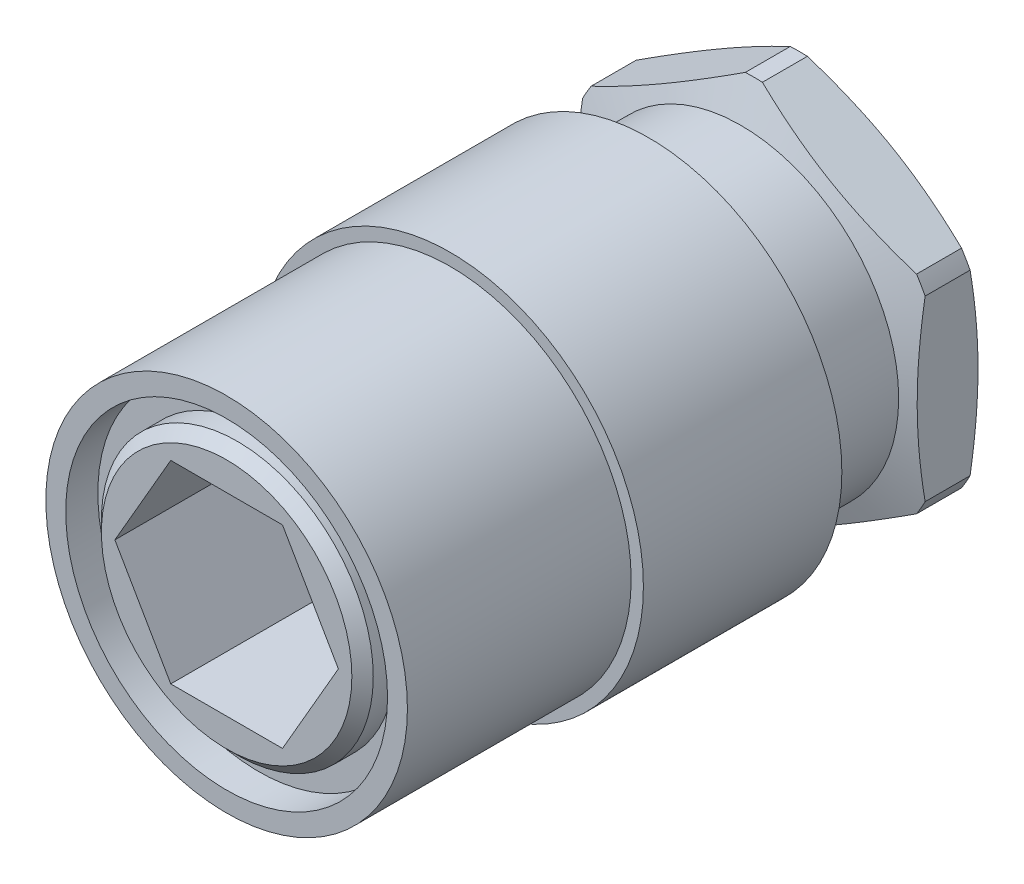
ISO-10303-21;
HEADER;
FILE_DESCRIPTION(('STEP AP214'),'2;1');
FILE_NAME('part.step','',(''),(''),'','','');
FILE_SCHEMA(('AUTOMOTIVE_DESIGN { 1 0 10303 214 1 1 1 1 }'));
ENDSEC;
DATA;
#1=APPLICATION_CONTEXT('core data for automotive mechanical design processes');
#2=APPLICATION_PROTOCOL_DEFINITION('international standard','automotive_design',2000,#1);
#3=PRODUCT_CONTEXT('',#1,'mechanical');
#4=PRODUCT('Part','Part','',(#3));
#5=PRODUCT_RELATED_PRODUCT_CATEGORY('part','',(#4));
#6=PRODUCT_DEFINITION_FORMATION('','',#4);
#7=PRODUCT_DEFINITION_CONTEXT('part definition',#1,'design');
#8=PRODUCT_DEFINITION('design','',#6,#7);
#9=PRODUCT_DEFINITION_SHAPE('','',#8);
#10=(LENGTH_UNIT() NAMED_UNIT(*) SI_UNIT(.MILLI.,.METRE.));
#11=(NAMED_UNIT(*) PLANE_ANGLE_UNIT() SI_UNIT($,.RADIAN.));
#12=(NAMED_UNIT(*) SI_UNIT($,.STERADIAN.) SOLID_ANGLE_UNIT());
#13=UNCERTAINTY_MEASURE_WITH_UNIT(LENGTH_MEASURE(1.E-05),#10,'distance_accuracy_value','');
#14=(GEOMETRIC_REPRESENTATION_CONTEXT(3) GLOBAL_UNCERTAINTY_ASSIGNED_CONTEXT((#13)) GLOBAL_UNIT_ASSIGNED_CONTEXT((#10,
#11,#12)) REPRESENTATION_CONTEXT('',''));
#15=CARTESIAN_POINT('',(0.,0.,0.));
#16=DIRECTION('',(0.,0.,1.));
#17=DIRECTION('',(1.,0.,0.));
#18=AXIS2_PLACEMENT_3D('',#15,#16,#17);
#19=CARTESIAN_POINT('',(0.,0.,-27.3304));
#20=DIRECTION('',(0.,0.,1.));
#21=DIRECTION('',(1.,0.,0.));
#22=AXIS2_PLACEMENT_3D('',#19,#20,#21);
#23=CYLINDRICAL_SURFACE('',#22,9.017);
#24=CARTESIAN_POINT('',(0.,0.,-19.7231));
#25=DIRECTION('',(0.,0.,-1.));
#26=DIRECTION('',(-1.,0.,0.));
#27=AXIS2_PLACEMENT_3D('',#24,#25,#26);
#28=CIRCLE('',#27,9.017);
#29=CARTESIAN_POINT('',(9.017,0.,-19.7231));
#30=VERTEX_POINT('',#29);
#31=EDGE_CURVE('E390',#30,#30,#28,.F.);
#32=CARTESIAN_POINT('',(0.,0.,-10.4521));
#33=DIRECTION('',(0.,0.,1.));
#34=DIRECTION('',(1.,0.,0.));
#35=AXIS2_PLACEMENT_3D('',#32,#33,#34);
#36=CIRCLE('',#35,9.017);
#37=CARTESIAN_POINT('',(9.017,0.,-10.4521));
#38=VERTEX_POINT('',#37);
#39=EDGE_CURVE('E211',#38,#38,#36,.T.);
#40=CARTESIAN_POINT('',(9.017,0.,-19.7231));
#41=CARTESIAN_POINT('',(9.017,0.,-19.6265270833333));
#42=CARTESIAN_POINT('',(9.017,0.,-19.5299541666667));
#43=CARTESIAN_POINT('',(9.017,0.,-19.3368083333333));
#44=CARTESIAN_POINT('',(9.017,0.,-19.2402354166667));
#45=CARTESIAN_POINT('',(9.017,0.,-19.0470895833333));
#46=CARTESIAN_POINT('',(9.017,0.,-18.9505166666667));
#47=CARTESIAN_POINT('',(9.017,0.,-18.7573708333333));
#48=CARTESIAN_POINT('',(9.017,0.,-18.6607979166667));
#49=CARTESIAN_POINT('',(9.017,0.,-18.4676520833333));
#50=CARTESIAN_POINT('',(9.017,0.,-18.3710791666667));
#51=CARTESIAN_POINT('',(9.017,0.,-18.1779333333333));
#52=CARTESIAN_POINT('',(9.017,0.,-18.0813604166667));
#53=CARTESIAN_POINT('',(9.017,0.,-17.8882145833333));
#54=CARTESIAN_POINT('',(9.017,0.,-17.7916416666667));
#55=CARTESIAN_POINT('',(9.017,0.,-17.5984958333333));
#56=CARTESIAN_POINT('',(9.017,0.,-17.5019229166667));
#57=CARTESIAN_POINT('',(9.017,0.,-17.3087770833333));
#58=CARTESIAN_POINT('',(9.017,0.,-17.2122041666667));
#59=CARTESIAN_POINT('',(9.017,0.,-17.0190583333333));
#60=CARTESIAN_POINT('',(9.017,0.,-16.9224854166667));
#61=CARTESIAN_POINT('',(9.017,0.,-16.7293395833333));
#62=CARTESIAN_POINT('',(9.017,0.,-16.6327666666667));
#63=CARTESIAN_POINT('',(9.017,0.,-16.4396208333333));
#64=CARTESIAN_POINT('',(9.017,0.,-16.3430479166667));
#65=CARTESIAN_POINT('',(9.017,0.,-16.1499020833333));
#66=CARTESIAN_POINT('',(9.017,0.,-16.0533291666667));
#67=CARTESIAN_POINT('',(9.017,0.,-15.8601833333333));
#68=CARTESIAN_POINT('',(9.017,0.,-15.7636104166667));
#69=CARTESIAN_POINT('',(9.017,0.,-15.5704645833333));
#70=CARTESIAN_POINT('',(9.017,0.,-15.4738916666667));
#71=CARTESIAN_POINT('',(9.017,0.,-15.2807458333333));
#72=CARTESIAN_POINT('',(9.017,0.,-15.1841729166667));
#73=CARTESIAN_POINT('',(9.017,0.,-14.9910270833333));
#74=CARTESIAN_POINT('',(9.017,0.,-14.8944541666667));
#75=CARTESIAN_POINT('',(9.017,0.,-14.7013083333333));
#76=CARTESIAN_POINT('',(9.017,0.,-14.6047354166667));
#77=CARTESIAN_POINT('',(9.017,0.,-14.4115895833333));
#78=CARTESIAN_POINT('',(9.017,0.,-14.3150166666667));
#79=CARTESIAN_POINT('',(9.017,0.,-14.1218708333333));
#80=CARTESIAN_POINT('',(9.017,0.,-14.0252979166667));
#81=CARTESIAN_POINT('',(9.017,0.,-13.8321520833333));
#82=CARTESIAN_POINT('',(9.017,0.,-13.7355791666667));
#83=CARTESIAN_POINT('',(9.017,0.,-13.5424333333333));
#84=CARTESIAN_POINT('',(9.017,0.,-13.4458604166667));
#85=CARTESIAN_POINT('',(9.017,0.,-13.2527145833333));
#86=CARTESIAN_POINT('',(9.017,0.,-13.1561416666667));
#87=CARTESIAN_POINT('',(9.017,0.,-12.9629958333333));
#88=CARTESIAN_POINT('',(9.017,0.,-12.8664229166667));
#89=CARTESIAN_POINT('',(9.017,0.,-12.6732770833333));
#90=CARTESIAN_POINT('',(9.017,0.,-12.5767041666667));
#91=CARTESIAN_POINT('',(9.017,0.,-12.3835583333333));
#92=CARTESIAN_POINT('',(9.017,0.,-12.2869854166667));
#93=CARTESIAN_POINT('',(9.017,0.,-12.0938395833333));
#94=CARTESIAN_POINT('',(9.017,0.,-11.9972666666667));
#95=CARTESIAN_POINT('',(9.017,0.,-11.8041208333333));
#96=CARTESIAN_POINT('',(9.017,0.,-11.7075479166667));
#97=CARTESIAN_POINT('',(9.017,0.,-11.5144020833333));
#98=CARTESIAN_POINT('',(9.017,0.,-11.4178291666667));
#99=CARTESIAN_POINT('',(9.017,0.,-11.2246833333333));
#100=CARTESIAN_POINT('',(9.017,0.,-11.1281104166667));
#101=CARTESIAN_POINT('',(9.017,0.,-10.9349645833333));
#102=CARTESIAN_POINT('',(9.017,0.,-10.8383916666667));
#103=CARTESIAN_POINT('',(9.017,0.,-10.6452458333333));
#104=CARTESIAN_POINT('',(9.017,0.,-10.5486729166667));
#105=CARTESIAN_POINT('',(9.017,0.,-10.4521));
#106=B_SPLINE_CURVE_WITH_KNOTS('',3,(#40,#41,#42,#43,#44,#45,#46,#47,#48,#49,#50,#51,#52,#53,
#54,#55,#56,#57,#58,#59,#60,#61,#62,#63,#64,#65,#66,#67,#68,#69,#70,#71,#72,#73,#74,#75,#76,#77,
#78,#79,#80,#81,#82,#83,#84,#85,#86,#87,#88,#89,#90,#91,#92,#93,#94,#95,#96,#97,#98,#99,#100,
#101,#102,#103,#104,#105),.UNSPECIFIED.,.F.,.F.,(4,2,2,2,2,2,2,2,2,2,2,2,2,2,2,2,2,2,2,2,2,2,2,
2,2,2,2,2,2,2,2,2,4),(0.,0.289718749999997,0.579437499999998,0.869156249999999,1.158875,
1.44859375,1.7383125,2.02803125,2.31775,2.60746875,2.8971875,3.18690625,3.476625,3.76634375,
4.0560625,4.34578125,4.6355,4.92521875,5.2149375,5.50465625,5.794375,6.08409375,6.3738125,
6.66353125,6.95325,7.24296875,7.5326875,7.82240625,8.112125,8.40184375,8.6915625,8.98128125,
9.271),.UNSPECIFIED.);
#107=EDGE_CURVE('BSEAM36',#30,#38,#106,.T.);
#108=ORIENTED_EDGE('',*,*,#31,.T.);
#109=ORIENTED_EDGE('',*,*,#39,.F.);
#110=ORIENTED_EDGE('',*,*,#107,.T.);
#111=ORIENTED_EDGE('',*,*,#107,.F.);
#112=EDGE_LOOP('',(#108,#110,#109,#111));
#113=FACE_BOUND('',#112,.T.);
#114=ADVANCED_FACE('F36',(#113),#23,.T.);
#115=DIRECTION('',(0.,0.,1.));
#116=VECTOR('',#115,1.);
#117=CARTESIAN_POINT('',(8.001,4.15815920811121,-27.3304));
#118=LINE('',#117,#116);
#119=CARTESIAN_POINT('',(8.001,4.15815920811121,-24.6293148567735));
#120=VERTEX_POINT('',#119);
#121=CARTESIAN_POINT('',(8.001,4.15815920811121,-26.7294851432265));
#122=VERTEX_POINT('',#121);
#123=EDGE_CURVE('E381',#120,#122,#118,.F.);
#124=ORIENTED_EDGE('',*,*,#123,.T.);
#125=CARTESIAN_POINT('',(0.,0.,-26.7294851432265));
#126=DIRECTION('',(0.,0.,1.));
#127=DIRECTION('',(1.,0.,0.));
#128=AXIS2_PLACEMENT_3D('',#125,#126,#127);
#129=CIRCLE('',#128,9.017);
#130=CARTESIAN_POINT('',(7.60157150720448,4.8499896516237,-26.7294851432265));
#131=VERTEX_POINT('',#130);
#132=EDGE_CURVE('E60',#122,#131,#129,.T.);
#133=ORIENTED_EDGE('',*,*,#132,.T.);
#134=DIRECTION('',(0.,0.,1.));
#135=VECTOR('',#134,1.);
#136=CARTESIAN_POINT('',(7.60157150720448,4.8499896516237,-27.3304));
#137=LINE('',#136,#135);
#138=CARTESIAN_POINT('',(7.60157150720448,4.8499896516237,-24.6293148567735));
#139=VERTEX_POINT('',#138);
#140=EDGE_CURVE('E379',#131,#139,#137,.T.);
#141=ORIENTED_EDGE('',*,*,#140,.T.);
#142=CARTESIAN_POINT('',(0.,0.,-24.6293148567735));
#143=DIRECTION('',(0.,0.,-1.));
#144=DIRECTION('',(-1.,0.,0.));
#145=AXIS2_PLACEMENT_3D('',#142,#143,#144);
#146=CIRCLE('',#145,9.017);
#147=EDGE_CURVE('E307',#139,#120,#146,.T.);
#148=ORIENTED_EDGE('',*,*,#147,.T.);
#149=EDGE_LOOP('',(#124,#133,#141,#148));
#150=FACE_BOUND('',#149,.T.);
#151=ADVANCED_FACE('F352',(#150),#23,.T.);
#152=DIRECTION('',(0.,0.,1.));
#153=VECTOR('',#152,1.);
#154=CARTESIAN_POINT('',(0.399428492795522,9.00814885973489,-27.3304));
#155=LINE('',#154,#153);
#156=CARTESIAN_POINT('',(0.399428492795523,9.0081488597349,-24.6293148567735));
#157=VERTEX_POINT('',#156);
#158=CARTESIAN_POINT('',(0.399428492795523,9.0081488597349,-26.7294851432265));
#159=VERTEX_POINT('',#158);
#160=EDGE_CURVE('E375',#157,#159,#155,.F.);
#161=ORIENTED_EDGE('',*,*,#160,.T.);
#162=CARTESIAN_POINT('',(0.,0.,-26.7294851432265));
#163=DIRECTION('',(0.,0.,1.));
#164=DIRECTION('',(1.,0.,0.));
#165=AXIS2_PLACEMENT_3D('',#162,#163,#164);
#166=CIRCLE('',#165,9.017);
#167=CARTESIAN_POINT('',(-0.399428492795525,9.0081488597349,-26.7294851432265));
#168=VERTEX_POINT('',#167);
#169=EDGE_CURVE('E376',#159,#168,#166,.T.);
#170=ORIENTED_EDGE('',*,*,#169,.T.);
#171=DIRECTION('',(0.,0.,1.));
#172=VECTOR('',#171,1.);
#173=CARTESIAN_POINT('',(-0.399428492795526,9.0081488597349,-27.3304));
#174=LINE('',#173,#172);
#175=CARTESIAN_POINT('',(-0.399428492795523,9.0081488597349,-24.6293148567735));
#176=VERTEX_POINT('',#175);
#177=EDGE_CURVE('E458',#168,#176,#174,.T.);
#178=ORIENTED_EDGE('',*,*,#177,.T.);
#179=CARTESIAN_POINT('',(0.,0.,-24.6293148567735));
#180=DIRECTION('',(0.,0.,-1.));
#181=DIRECTION('',(-1.,0.,0.));
#182=AXIS2_PLACEMENT_3D('',#179,#180,#181);
#183=CIRCLE('',#182,9.017);
#184=EDGE_CURVE('E327',#176,#157,#183,.T.);
#185=ORIENTED_EDGE('',*,*,#184,.T.);
#186=EDGE_LOOP('',(#161,#170,#178,#185));
#187=FACE_BOUND('',#186,.T.);
#188=ADVANCED_FACE('F355',(#187),#23,.T.);
#189=DIRECTION('',(0.,0.,1.));
#190=VECTOR('',#189,1.);
#191=CARTESIAN_POINT('',(-7.60157150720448,4.8499896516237,-27.3304));
#192=LINE('',#191,#190);
#193=CARTESIAN_POINT('',(-7.60157150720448,4.8499896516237,-24.6293148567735));
#194=VERTEX_POINT('',#193);
#195=CARTESIAN_POINT('',(-7.60157150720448,4.8499896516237,-26.7294851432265));
#196=VERTEX_POINT('',#195);
#197=EDGE_CURVE('E383',#194,#196,#192,.F.);
#198=ORIENTED_EDGE('',*,*,#197,.T.);
#199=CARTESIAN_POINT('',(0.,0.,-26.7294851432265));
#200=DIRECTION('',(0.,0.,1.));
#201=DIRECTION('',(1.,0.,0.));
#202=AXIS2_PLACEMENT_3D('',#199,#200,#201);
#203=CIRCLE('',#202,9.017);
#204=CARTESIAN_POINT('',(-8.00099999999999,4.15815920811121,-26.7294851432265));
#205=VERTEX_POINT('',#204);
#206=EDGE_CURVE('E462',#196,#205,#203,.T.);
#207=ORIENTED_EDGE('',*,*,#206,.T.);
#208=DIRECTION('',(0.,0.,1.));
#209=VECTOR('',#208,1.);
#210=CARTESIAN_POINT('',(-8.00099999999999,4.15815920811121,-27.3304));
#211=LINE('',#210,#209);
#212=CARTESIAN_POINT('',(-8.00099999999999,4.15815920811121,-24.6293148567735));
#213=VERTEX_POINT('',#212);
#214=EDGE_CURVE('E453',#205,#213,#211,.T.);
#215=ORIENTED_EDGE('',*,*,#214,.T.);
#216=CARTESIAN_POINT('',(0.,0.,-24.6293148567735));
#217=DIRECTION('',(0.,0.,-1.));
#218=DIRECTION('',(-1.,0.,0.));
#219=AXIS2_PLACEMENT_3D('',#216,#217,#218);
#220=CIRCLE('',#219,9.017);
#221=EDGE_CURVE('E336',#213,#194,#220,.T.);
#222=ORIENTED_EDGE('',*,*,#221,.T.);
#223=EDGE_LOOP('',(#198,#207,#215,#222));
#224=FACE_BOUND('',#223,.T.);
#225=ADVANCED_FACE('F365',(#224),#23,.T.);
#226=DIRECTION('',(0.,0.,1.));
#227=VECTOR('',#226,1.);
#228=CARTESIAN_POINT('',(-8.001,-4.15815920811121,-27.3304));
#229=LINE('',#228,#227);
#230=CARTESIAN_POINT('',(-8.001,-4.15815920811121,-24.6293148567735));
#231=VERTEX_POINT('',#230);
#232=CARTESIAN_POINT('',(-8.001,-4.15815920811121,-26.7294851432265));
#233=VERTEX_POINT('',#232);
#234=EDGE_CURVE('E455',#231,#233,#229,.F.);
#235=ORIENTED_EDGE('',*,*,#234,.T.);
#236=CARTESIAN_POINT('',(0.,0.,-26.7294851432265));
#237=DIRECTION('',(0.,0.,1.));
#238=DIRECTION('',(1.,0.,0.));
#239=AXIS2_PLACEMENT_3D('',#236,#237,#238);
#240=CIRCLE('',#239,9.017);
#241=CARTESIAN_POINT('',(-7.60157150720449,-4.84998965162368,-26.7294851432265));
#242=VERTEX_POINT('',#241);
#243=EDGE_CURVE('E287',#233,#242,#240,.T.);
#244=ORIENTED_EDGE('',*,*,#243,.T.);
#245=DIRECTION('',(0.,0.,1.));
#246=VECTOR('',#245,1.);
#247=CARTESIAN_POINT('',(-7.60157150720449,-4.84998965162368,-27.3304));
#248=LINE('',#247,#246);
#249=CARTESIAN_POINT('',(-7.60157150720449,-4.84998965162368,-24.6293148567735));
#250=VERTEX_POINT('',#249);
#251=EDGE_CURVE('E448',#242,#250,#248,.T.);
#252=ORIENTED_EDGE('',*,*,#251,.T.);
#253=CARTESIAN_POINT('',(0.,0.,-24.6293148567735));
#254=DIRECTION('',(0.,0.,-1.));
#255=DIRECTION('',(-1.,0.,0.));
#256=AXIS2_PLACEMENT_3D('',#253,#254,#255);
#257=CIRCLE('',#256,9.017);
#258=EDGE_CURVE('E318',#250,#231,#257,.T.);
#259=ORIENTED_EDGE('',*,*,#258,.T.);
#260=EDGE_LOOP('',(#235,#244,#252,#259));
#261=FACE_BOUND('',#260,.T.);
#262=ADVANCED_FACE('F370',(#261),#23,.T.);
#263=DIRECTION('',(0.,0.,1.));
#264=VECTOR('',#263,1.);
#265=CARTESIAN_POINT('',(-0.399428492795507,-9.0081488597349,-27.3304));
#266=LINE('',#265,#264);
#267=CARTESIAN_POINT('',(-0.399428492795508,-9.0081488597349,-24.6293148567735));
#268=VERTEX_POINT('',#267);
#269=CARTESIAN_POINT('',(-0.399428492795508,-9.0081488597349,-26.7294851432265));
#270=VERTEX_POINT('',#269);
#271=EDGE_CURVE('E450',#268,#270,#266,.F.);
#272=ORIENTED_EDGE('',*,*,#271,.T.);
#273=CARTESIAN_POINT('',(0.,0.,-26.7294851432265));
#274=DIRECTION('',(0.,0.,1.));
#275=DIRECTION('',(1.,0.,0.));
#276=AXIS2_PLACEMENT_3D('',#273,#274,#275);
#277=CIRCLE('',#276,9.017);
#278=CARTESIAN_POINT('',(0.399428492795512,-9.0081488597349,-26.7294851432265));
#279=VERTEX_POINT('',#278);
#280=EDGE_CURVE('E466',#270,#279,#277,.T.);
#281=ORIENTED_EDGE('',*,*,#280,.T.);
#282=DIRECTION('',(0.,0.,1.));
#283=VECTOR('',#282,1.);
#284=CARTESIAN_POINT('',(0.399428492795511,-9.0081488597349,-27.3304));
#285=LINE('',#284,#283);
#286=CARTESIAN_POINT('',(0.399428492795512,-9.0081488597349,-24.6293148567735));
#287=VERTEX_POINT('',#286);
#288=EDGE_CURVE('E391',#279,#287,#285,.T.);
#289=ORIENTED_EDGE('',*,*,#288,.T.);
#290=CARTESIAN_POINT('',(0.,0.,-24.6293148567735));
#291=DIRECTION('',(0.,0.,-1.));
#292=DIRECTION('',(-1.,0.,0.));
#293=AXIS2_PLACEMENT_3D('',#290,#291,#292);
#294=CIRCLE('',#293,9.017);
#295=EDGE_CURVE('E308',#287,#268,#294,.T.);
#296=ORIENTED_EDGE('',*,*,#295,.T.);
#297=EDGE_LOOP('',(#272,#281,#289,#296));
#298=FACE_BOUND('',#297,.T.);
#299=ADVANCED_FACE('F741',(#298),#23,.T.);
#300=DIRECTION('',(0.,0.,1.));
#301=VECTOR('',#300,1.);
#302=CARTESIAN_POINT('',(7.60157150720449,-4.84998965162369,-27.3304));
#303=LINE('',#302,#301);
#304=CARTESIAN_POINT('',(7.60157150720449,-4.84998965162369,-24.6293148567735));
#305=VERTEX_POINT('',#304);
#306=CARTESIAN_POINT('',(7.60157150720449,-4.84998965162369,-26.7294851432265));
#307=VERTEX_POINT('',#306);
#308=EDGE_CURVE('E446',#305,#307,#303,.F.);
#309=ORIENTED_EDGE('',*,*,#308,.T.);
#310=CARTESIAN_POINT('',(0.,0.,-26.7294851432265));
#311=DIRECTION('',(0.,0.,1.));
#312=DIRECTION('',(1.,0.,0.));
#313=AXIS2_PLACEMENT_3D('',#310,#311,#312);
#314=CIRCLE('',#313,9.017);
#315=CARTESIAN_POINT('',(8.001,-4.15815920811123,-26.7294851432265));
#316=VERTEX_POINT('',#315);
#317=EDGE_CURVE('E226',#307,#316,#314,.T.);
#318=ORIENTED_EDGE('',*,*,#317,.T.);
#319=DIRECTION('',(0.,0.,1.));
#320=VECTOR('',#319,1.);
#321=CARTESIAN_POINT('',(8.001,-4.15815920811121,-27.3304));
#322=LINE('',#321,#320);
#323=CARTESIAN_POINT('',(8.001,-4.1581592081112,-24.6293148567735));
#324=VERTEX_POINT('',#323);
#325=EDGE_CURVE('E378',#316,#324,#322,.T.);
#326=ORIENTED_EDGE('',*,*,#325,.T.);
#327=CARTESIAN_POINT('',(0.,0.,-24.6293148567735));
#328=DIRECTION('',(0.,0.,-1.));
#329=DIRECTION('',(-1.,0.,0.));
#330=AXIS2_PLACEMENT_3D('',#327,#328,#329);
#331=CIRCLE('',#330,9.017);
#332=EDGE_CURVE('E389',#324,#305,#331,.T.);
#333=ORIENTED_EDGE('',*,*,#332,.T.);
#334=EDGE_LOOP('',(#309,#318,#326,#333));
#335=FACE_BOUND('',#334,.T.);
#336=ADVANCED_FACE('F360',(#335),#23,.T.);
#337=CARTESIAN_POINT('',(8.001,-4.61937950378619,-24.0284));
#338=DIRECTION('',(0.5,-0.866025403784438,0.));
#339=DIRECTION('',(0.866025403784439,0.5,0.));
#340=AXIS2_PLACEMENT_3D('',#337,#338,#339);
#341=PLANE('',#340);
#342=ORIENTED_EDGE('',*,*,#288,.F.);
#343=CARTESIAN_POINT('',(0.399228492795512,-9.00826432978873,-26.7294463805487));
#344=CARTESIAN_POINT('',(0.697739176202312,-8.83591910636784,-26.7873360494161));
#345=CARTESIAN_POINT('',(0.997124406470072,-8.66306896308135,-26.8396746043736));
#346=CARTESIAN_POINT('',(1.59753705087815,-8.31642056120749,-26.9313664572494));
#347=CARTESIAN_POINT('',(1.8985652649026,-8.1426218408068,-26.9707127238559));
#348=CARTESIAN_POINT('',(2.4994606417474,-7.79569473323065,-27.0342194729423));
#349=CARTESIAN_POINT('',(2.79931830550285,-7.62257183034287,-27.0584969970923));
#350=CARTESIAN_POINT('',(3.39961742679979,-7.27598897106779,-27.0910246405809));
#351=CARTESIAN_POINT('',(3.7000587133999,-7.10252911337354,-27.099278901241));
#352=CARTESIAN_POINT('',(4.30094128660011,-6.75560939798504,-27.099278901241));
#353=CARTESIAN_POINT('',(4.60138257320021,-6.58214954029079,-27.0910246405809));
#354=CARTESIAN_POINT('',(5.20168169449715,-6.23556668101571,-27.0584969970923));
#355=CARTESIAN_POINT('',(5.5015393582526,-6.06244377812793,-27.0342194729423));
#356=CARTESIAN_POINT('',(6.1024347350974,-5.71551667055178,-26.9707127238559));
#357=CARTESIAN_POINT('',(6.40346294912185,-5.54171795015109,-26.9313664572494));
#358=CARTESIAN_POINT('',(7.00387559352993,-5.19506954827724,-26.8396746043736));
#359=CARTESIAN_POINT('',(7.30326082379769,-5.02221940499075,-26.7873360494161));
#360=CARTESIAN_POINT('',(7.60177150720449,-4.84987418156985,-26.7294463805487));
#361=B_SPLINE_CURVE_WITH_KNOTS('',3,(#343,#344,#345,#346,#347,#348,#349,#350,#351,#352,#353,
#354,#355,#356,#357,#358,#359,#360),.UNSPECIFIED.,.F.,.F.,(4,2,2,2,2,2,2,2,4),(0.,
1.04862351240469,2.09781360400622,3.13874897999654,4.17941528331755,5.22008158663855,
6.26101696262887,7.3102070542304,8.35883056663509),.UNSPECIFIED.);
#362=EDGE_CURVE('E238',#279,#307,#361,.T.);
#363=ORIENTED_EDGE('',*,*,#362,.T.);
#364=ORIENTED_EDGE('',*,*,#308,.F.);
#365=CARTESIAN_POINT('',(7.60177150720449,-4.84987418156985,-24.6293536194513));
#366=CARTESIAN_POINT('',(7.30326082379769,-5.02221940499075,-24.5714639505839));
#367=CARTESIAN_POINT('',(7.00387559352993,-5.19506954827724,-24.5191253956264));
#368=CARTESIAN_POINT('',(6.40346294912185,-5.54171795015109,-24.4274335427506));
#369=CARTESIAN_POINT('',(6.1024347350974,-5.71551667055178,-24.3880872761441));
#370=CARTESIAN_POINT('',(5.5015393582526,-6.06244377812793,-24.3245805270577));
#371=CARTESIAN_POINT('',(5.20168169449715,-6.23556668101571,-24.3003030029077));
#372=CARTESIAN_POINT('',(4.60138257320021,-6.58214954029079,-24.2677753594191));
#373=CARTESIAN_POINT('',(4.30094128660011,-6.75560939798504,-24.259521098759));
#374=CARTESIAN_POINT('',(3.7000587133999,-7.10252911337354,-24.259521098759));
#375=CARTESIAN_POINT('',(3.39961742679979,-7.27598897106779,-24.2677753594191));
#376=CARTESIAN_POINT('',(2.79931830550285,-7.62257183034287,-24.3003030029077));
#377=CARTESIAN_POINT('',(2.4994606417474,-7.79569473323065,-24.3245805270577));
#378=CARTESIAN_POINT('',(1.8985652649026,-8.1426218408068,-24.3880872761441));
#379=CARTESIAN_POINT('',(1.59753705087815,-8.31642056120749,-24.4274335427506));
#380=CARTESIAN_POINT('',(0.997124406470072,-8.66306896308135,-24.5191253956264));
#381=CARTESIAN_POINT('',(0.697739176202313,-8.83591910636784,-24.5714639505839));
#382=CARTESIAN_POINT('',(0.399228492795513,-9.00826432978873,-24.6293536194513));
#383=B_SPLINE_CURVE_WITH_KNOTS('',3,(#365,#366,#367,#368,#369,#370,#371,#372,#373,#374,#375,
#376,#377,#378,#379,#380,#381,#382),.UNSPECIFIED.,.F.,.F.,(4,2,2,2,2,2,2,2,4),(0.,
1.04862351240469,2.09781360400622,3.13874897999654,4.17941528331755,5.22008158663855,
6.26101696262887,7.3102070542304,8.35883056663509),.UNSPECIFIED.);
#384=EDGE_CURVE('E477',#305,#287,#383,.T.);
#385=ORIENTED_EDGE('',*,*,#384,.T.);
#386=EDGE_LOOP('',(#342,#363,#364,#385));
#387=FACE_BOUND('',#386,.T.);
#388=ADVANCED_FACE('F294',(#387),#341,.T.);
#389=CARTESIAN_POINT('',(0.,-9.23875900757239,-24.0284));
#390=DIRECTION('',(-0.5,-0.866025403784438,0.));
#391=DIRECTION('',(0.866025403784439,-0.5,0.));
#392=AXIS2_PLACEMENT_3D('',#389,#390,#391);
#393=PLANE('',#392);
#394=ORIENTED_EDGE('',*,*,#251,.F.);
#395=CARTESIAN_POINT('',(-7.60177150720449,-4.84987418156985,-26.7294463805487));
#396=CARTESIAN_POINT('',(-7.30326082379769,-5.02221940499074,-26.7873360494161));
#397=CARTESIAN_POINT('',(-7.00387559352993,-5.19506954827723,-26.8396746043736));
#398=CARTESIAN_POINT('',(-6.40346294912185,-5.54171795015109,-26.9313664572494));
#399=CARTESIAN_POINT('',(-6.1024347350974,-5.71551667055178,-26.9707127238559));
#400=CARTESIAN_POINT('',(-5.5015393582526,-6.06244377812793,-27.0342194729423));
#401=CARTESIAN_POINT('',(-5.20168169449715,-6.23556668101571,-27.0584969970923));
#402=CARTESIAN_POINT('',(-4.60138257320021,-6.58214954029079,-27.0910246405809));
#403=CARTESIAN_POINT('',(-4.30094128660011,-6.75560939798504,-27.099278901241));
#404=CARTESIAN_POINT('',(-3.70005871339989,-7.10252911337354,-27.099278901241));
#405=CARTESIAN_POINT('',(-3.39961742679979,-7.27598897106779,-27.0910246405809));
#406=CARTESIAN_POINT('',(-2.79931830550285,-7.62257183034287,-27.0584969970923));
#407=CARTESIAN_POINT('',(-2.4994606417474,-7.79569473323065,-27.0342194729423));
#408=CARTESIAN_POINT('',(-1.8985652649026,-8.1426218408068,-26.9707127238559));
#409=CARTESIAN_POINT('',(-1.59753705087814,-8.31642056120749,-26.9313664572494));
#410=CARTESIAN_POINT('',(-0.997124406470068,-8.66306896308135,-26.8396746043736));
#411=CARTESIAN_POINT('',(-0.697739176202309,-8.83591910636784,-26.7873360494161));
#412=CARTESIAN_POINT('',(-0.399228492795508,-9.00826432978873,-26.7294463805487));
#413=B_SPLINE_CURVE_WITH_KNOTS('',3,(#395,#396,#397,#398,#399,#400,#401,#402,#403,#404,#405,
#406,#407,#408,#409,#410,#411,#412),.UNSPECIFIED.,.F.,.F.,(4,2,2,2,2,2,2,2,4),(0.,
1.04862351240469,2.09781360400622,3.13874897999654,4.17941528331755,5.22008158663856,
6.26101696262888,7.31020705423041,8.3588305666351),.UNSPECIFIED.);
#414=EDGE_CURVE('E280',#242,#270,#413,.T.);
#415=ORIENTED_EDGE('',*,*,#414,.T.);
#416=ORIENTED_EDGE('',*,*,#271,.F.);
#417=CARTESIAN_POINT('',(-0.399228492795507,-9.00826432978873,-24.6293536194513));
#418=CARTESIAN_POINT('',(-0.697739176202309,-8.83591910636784,-24.5714639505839));
#419=CARTESIAN_POINT('',(-0.997124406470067,-8.66306896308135,-24.5191253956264));
#420=CARTESIAN_POINT('',(-1.59753705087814,-8.31642056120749,-24.4274335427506));
#421=CARTESIAN_POINT('',(-1.8985652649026,-8.1426218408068,-24.3880872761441));
#422=CARTESIAN_POINT('',(-2.4994606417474,-7.79569473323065,-24.3245805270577));
#423=CARTESIAN_POINT('',(-2.79931830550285,-7.62257183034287,-24.3003030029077));
#424=CARTESIAN_POINT('',(-3.39961742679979,-7.27598897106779,-24.2677753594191));
#425=CARTESIAN_POINT('',(-3.70005871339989,-7.10252911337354,-24.259521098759));
#426=CARTESIAN_POINT('',(-4.3009412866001,-6.75560939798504,-24.259521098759));
#427=CARTESIAN_POINT('',(-4.60138257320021,-6.58214954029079,-24.2677753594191));
#428=CARTESIAN_POINT('',(-5.20168169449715,-6.23556668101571,-24.3003030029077));
#429=CARTESIAN_POINT('',(-5.5015393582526,-6.06244377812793,-24.3245805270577));
#430=CARTESIAN_POINT('',(-6.1024347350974,-5.71551667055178,-24.3880872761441));
#431=CARTESIAN_POINT('',(-6.40346294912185,-5.54171795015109,-24.4274335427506));
#432=CARTESIAN_POINT('',(-7.00387559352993,-5.19506954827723,-24.5191253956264));
#433=CARTESIAN_POINT('',(-7.30326082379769,-5.02221940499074,-24.5714639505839));
#434=CARTESIAN_POINT('',(-7.60177150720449,-4.84987418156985,-24.6293536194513));
#435=B_SPLINE_CURVE_WITH_KNOTS('',3,(#417,#418,#419,#420,#421,#422,#423,#424,#425,#426,#427,
#428,#429,#430,#431,#432,#433,#434),.UNSPECIFIED.,.F.,.F.,(4,2,2,2,2,2,2,2,4),(0.,
1.04862351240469,2.09781360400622,3.13874897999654,4.17941528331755,5.22008158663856,
6.26101696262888,7.31020705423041,8.3588305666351),.UNSPECIFIED.);
#436=EDGE_CURVE('E300',#268,#250,#435,.T.);
#437=ORIENTED_EDGE('',*,*,#436,.T.);
#438=EDGE_LOOP('',(#394,#415,#416,#437));
#439=FACE_BOUND('',#438,.T.);
#440=ADVANCED_FACE('F289',(#439),#393,.T.);
#441=CARTESIAN_POINT('',(-8.001,-4.61937950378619,-24.0284));
#442=DIRECTION('',(-1.,0.,0.));
#443=DIRECTION('',(0.,-1.,0.));
#444=AXIS2_PLACEMENT_3D('',#441,#442,#443);
#445=PLANE('',#444);
#446=ORIENTED_EDGE('',*,*,#214,.F.);
#447=CARTESIAN_POINT('',(-8.001,-11.7689898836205,-24.8316962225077));
#448=CARTESIAN_POINT('',(-8.001,-11.4118433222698,-24.9391648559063));
#449=CARTESIAN_POINT('',(-8.001,-11.0542795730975,-25.0452744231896));
#450=CARTESIAN_POINT('',(-8.001,-10.3381067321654,-25.2540227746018));
#451=CARTESIAN_POINT('',(-8.001,-9.97949754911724,-25.3566612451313));
#452=CARTESIAN_POINT('',(-8.001,-9.26029441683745,-25.5579169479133));
#453=CARTESIAN_POINT('',(-8.001,-8.89969783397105,-25.6565248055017));
#454=CARTESIAN_POINT('',(-8.001,-8.17709905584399,-25.848440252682));
#455=CARTESIAN_POINT('',(-8.001,-7.81509688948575,-25.9417479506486));
#456=CARTESIAN_POINT('',(-8.001,-7.09417799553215,-26.1205867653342));
#457=CARTESIAN_POINT('',(-8.001,-6.73528260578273,-26.2062034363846));
#458=CARTESIAN_POINT('',(-8.001,-6.01565552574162,-26.3694297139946));
#459=CARTESIAN_POINT('',(-8.001,-5.65492380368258,-26.4470391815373));
#460=CARTESIAN_POINT('',(-8.001,-4.93164103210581,-26.592288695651));
#461=CARTESIAN_POINT('',(-8.001,-4.56909105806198,-26.6599340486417));
#462=CARTESIAN_POINT('',(-8.001,-3.84191809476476,-26.7830719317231));
#463=CARTESIAN_POINT('',(-8.001,-3.47729518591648,-26.8385649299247));
#464=CARTESIAN_POINT('',(-8.001,-2.78750400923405,-26.9295645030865));
#465=CARTESIAN_POINT('',(-8.001,-2.46254233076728,-26.9666225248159));
#466=CARTESIAN_POINT('',(-8.001,-1.81139194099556,-27.0277749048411));
#467=CARTESIAN_POINT('',(-8.001,-1.48520326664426,-27.0518696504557));
#468=CARTESIAN_POINT('',(-8.001,-0.832251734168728,-27.0859271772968));
#469=CARTESIAN_POINT('',(-8.001,-0.505489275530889,-27.095897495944));
#470=CARTESIAN_POINT('',(-8.001,0.148156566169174,-27.1012083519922));
#471=CARTESIAN_POINT('',(-8.001,0.475039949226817,-27.0965488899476));
#472=CARTESIAN_POINT('',(-8.001,1.12991070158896,-27.0727878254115));
#473=CARTESIAN_POINT('',(-8.001,1.45789541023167,-27.0536140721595));
#474=CARTESIAN_POINT('',(-8.001,2.1127803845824,-27.0017069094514));
#475=CARTESIAN_POINT('',(-8.00099999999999,2.43968062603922,-26.9689731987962));
#476=CARTESIAN_POINT('',(-8.00099999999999,3.09226964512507,-26.8913733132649));
#477=CARTESIAN_POINT('',(-8.00099999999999,3.4179573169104,-26.8464979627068));
#478=CARTESIAN_POINT('',(-8.00099999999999,4.06770520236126,-26.7462939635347));
#479=CARTESIAN_POINT('',(-8.00099999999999,4.39176540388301,-26.6909652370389));
#480=CARTESIAN_POINT('',(-8.00099999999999,5.02897687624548,-26.5732166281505));
#481=CARTESIAN_POINT('',(-8.00099999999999,5.34217454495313,-26.5110455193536));
#482=CARTESIAN_POINT('',(-8.00099999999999,5.96712055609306,-26.3797659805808));
#483=CARTESIAN_POINT('',(-8.00099999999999,6.27886882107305,-26.3106571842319));
#484=CARTESIAN_POINT('',(-8.00099999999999,6.90109193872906,-26.1666765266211));
#485=CARTESIAN_POINT('',(-8.00099999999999,7.21156651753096,-26.0918034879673));
#486=CARTESIAN_POINT('',(-8.00099999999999,7.83131974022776,-25.937301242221));
#487=CARTESIAN_POINT('',(-8.00099999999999,8.14059840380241,-25.8576721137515));
#488=CARTESIAN_POINT('',(-8.00099999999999,8.75838676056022,-25.6944020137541));
#489=CARTESIAN_POINT('',(-8.00099999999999,9.06689552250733,-25.6107575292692));
#490=CARTESIAN_POINT('',(-8.00099999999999,9.68300513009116,-25.4401836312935));
#491=CARTESIAN_POINT('',(-8.00099999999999,9.99060596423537,-25.3532541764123));
#492=CARTESIAN_POINT('',(-8.00099999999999,10.912152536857,-25.0884014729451));
#493=CARTESIAN_POINT('',(-8.00099999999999,11.5249236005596,-24.9063920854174));
#494=CARTESIAN_POINT('',(-8.00099999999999,12.7410773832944,-24.5368176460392));
#495=CARTESIAN_POINT('',(-8.00099999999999,13.3444870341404,-24.3493405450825));
#496=CARTESIAN_POINT('',(-8.00099999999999,14.5495866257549,-23.9688780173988));
#497=CARTESIAN_POINT('',(-8.00099999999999,15.1512765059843,-23.7758923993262));
#498=CARTESIAN_POINT('',(-8.00099999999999,16.3515428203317,-23.3863924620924));
#499=CARTESIAN_POINT('',(-8.00099999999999,16.9501231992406,-23.1898902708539));
#500=CARTESIAN_POINT('',(-8.00099999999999,17.8471966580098,-22.8928026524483));
#501=CARTESIAN_POINT('',(-8.00099999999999,18.1460782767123,-22.7933877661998));
#502=CARTESIAN_POINT('',(-8.00099999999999,18.7436097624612,-22.5938663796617));
#503=CARTESIAN_POINT('',(-8.00099999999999,19.0422596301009,-22.4937598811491));
#504=CARTESIAN_POINT('',(-8.00099999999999,19.3408080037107,-22.3933516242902));
#505=B_SPLINE_CURVE_WITH_KNOTS('',3,(#447,#448,#449,#450,#451,#452,#453,#454,#455,#456,#457,
#458,#459,#460,#461,#462,#463,#464,#465,#466,#467,#468,#469,#470,#471,#472,#473,#474,#475,#476,
#477,#478,#479,#480,#481,#482,#483,#484,#485,#486,#487,#488,#489,#490,#491,#492,#493,#494,#495,
#496,#497,#498,#499,#500,#501,#502,#503,#504),.UNSPECIFIED.,.F.,.F.,(4,2,2,2,2,2,2,2,2,2,2,2,2,
2,2,2,2,2,2,2,2,2,2,2,2,2,2,2,4),(0.,1.11890524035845,2.23791130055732,3.35938697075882,
4.48083970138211,5.58766577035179,6.694511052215,7.80076473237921,8.90697579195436,
9.88795120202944,10.8688973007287,11.8493197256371,12.8297421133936,13.8150704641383,
14.8004207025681,15.7865176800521,16.7726220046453,17.7304555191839,18.6883396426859,
19.646419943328,20.6044844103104,21.5634029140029,22.5223335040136,24.4399423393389,
26.3355006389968,28.2311248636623,30.1211412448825,31.0660860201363,32.0110283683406),.UNSPECIFIED.);
#506=EDGE_CURVE('E824',#205,#233,#505,.F.);
#507=ORIENTED_EDGE('',*,*,#506,.T.);
#508=ORIENTED_EDGE('',*,*,#234,.F.);
#509=CARTESIAN_POINT('',(-8.001,-11.7689898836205,-26.5271037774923));
#510=CARTESIAN_POINT('',(-8.001,-11.4118433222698,-26.4196351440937));
#511=CARTESIAN_POINT('',(-8.001,-11.0542795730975,-26.3135255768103));
#512=CARTESIAN_POINT('',(-8.001,-10.3381067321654,-26.1047772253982));
#513=CARTESIAN_POINT('',(-8.001,-9.97949754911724,-26.0021387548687));
#514=CARTESIAN_POINT('',(-8.001,-9.26029441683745,-25.8008830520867));
#515=CARTESIAN_POINT('',(-8.001,-8.89969783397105,-25.7022751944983));
#516=CARTESIAN_POINT('',(-8.001,-8.17709905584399,-25.510359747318));
#517=CARTESIAN_POINT('',(-8.001,-7.81509688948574,-25.4170520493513));
#518=CARTESIAN_POINT('',(-8.001,-7.09417799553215,-25.2382132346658));
#519=CARTESIAN_POINT('',(-8.001,-6.73528260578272,-25.1525965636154));
#520=CARTESIAN_POINT('',(-8.001,-6.01565552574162,-24.9893702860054));
#521=CARTESIAN_POINT('',(-8.001,-5.65492380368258,-24.9117608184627));
#522=CARTESIAN_POINT('',(-8.001,-4.93164103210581,-24.766511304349));
#523=CARTESIAN_POINT('',(-8.001,-4.56909105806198,-24.6988659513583));
#524=CARTESIAN_POINT('',(-8.001,-3.84191809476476,-24.5757280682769));
#525=CARTESIAN_POINT('',(-8.001,-3.47729518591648,-24.5202350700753));
#526=CARTESIAN_POINT('',(-8.001,-2.78750400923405,-24.4292354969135));
#527=CARTESIAN_POINT('',(-8.001,-2.46254233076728,-24.392177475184));
#528=CARTESIAN_POINT('',(-8.001,-1.81139194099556,-24.3310250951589));
#529=CARTESIAN_POINT('',(-8.001,-1.48520326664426,-24.3069303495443));
#530=CARTESIAN_POINT('',(-8.001,-0.832251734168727,-24.2728728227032));
#531=CARTESIAN_POINT('',(-8.001,-0.505489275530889,-24.262902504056));
#532=CARTESIAN_POINT('',(-8.001,0.148156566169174,-24.2575916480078));
#533=CARTESIAN_POINT('',(-8.001,0.475039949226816,-24.2622511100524));
#534=CARTESIAN_POINT('',(-8.001,1.12991070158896,-24.2860121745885));
#535=CARTESIAN_POINT('',(-8.001,1.45789541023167,-24.3051859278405));
#536=CARTESIAN_POINT('',(-8.001,2.1127803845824,-24.3570930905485));
#537=CARTESIAN_POINT('',(-8.00099999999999,2.43968062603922,-24.3898268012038));
#538=CARTESIAN_POINT('',(-8.00099999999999,3.09226964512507,-24.4674266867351));
#539=CARTESIAN_POINT('',(-8.00099999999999,3.4179573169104,-24.5123020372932));
#540=CARTESIAN_POINT('',(-8.00099999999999,4.06770520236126,-24.6125060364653));
#541=CARTESIAN_POINT('',(-8.00099999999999,4.39176540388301,-24.6678347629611));
#542=CARTESIAN_POINT('',(-8.00099999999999,5.02897687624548,-24.7855833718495));
#543=CARTESIAN_POINT('',(-8.00099999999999,5.34217454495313,-24.8477544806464));
#544=CARTESIAN_POINT('',(-8.00099999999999,5.96712055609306,-24.9790340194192));
#545=CARTESIAN_POINT('',(-8.00099999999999,6.27886882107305,-25.048142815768));
#546=CARTESIAN_POINT('',(-8.00099999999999,6.90109193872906,-25.1921234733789));
#547=CARTESIAN_POINT('',(-8.00099999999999,7.21156651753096,-25.2669965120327));
#548=CARTESIAN_POINT('',(-8.00099999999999,7.83131974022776,-25.421498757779));
#549=CARTESIAN_POINT('',(-8.00099999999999,8.14059840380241,-25.5011278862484));
#550=CARTESIAN_POINT('',(-8.00099999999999,8.75838676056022,-25.6643979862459));
#551=CARTESIAN_POINT('',(-8.00099999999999,9.06689552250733,-25.7480424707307));
#552=CARTESIAN_POINT('',(-8.00099999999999,9.68300513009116,-25.9186163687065));
#553=CARTESIAN_POINT('',(-8.00099999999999,9.99060596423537,-26.0055458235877));
#554=CARTESIAN_POINT('',(-8.00099999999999,10.912152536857,-26.2703985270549));
#555=CARTESIAN_POINT('',(-8.00099999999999,11.5249236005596,-26.4524079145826));
#556=CARTESIAN_POINT('',(-8.00099999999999,12.7410773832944,-26.8219823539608));
#557=CARTESIAN_POINT('',(-8.00099999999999,13.3444870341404,-27.0094594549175));
#558=CARTESIAN_POINT('',(-8.00099999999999,14.5495866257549,-27.3899219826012));
#559=CARTESIAN_POINT('',(-8.00099999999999,15.1512765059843,-27.5829076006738));
#560=CARTESIAN_POINT('',(-8.00099999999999,16.3515428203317,-27.9724075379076));
#561=CARTESIAN_POINT('',(-8.00099999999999,16.9501231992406,-28.1689097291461));
#562=CARTESIAN_POINT('',(-8.00099999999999,17.8471966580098,-28.4659973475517));
#563=CARTESIAN_POINT('',(-8.00099999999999,18.1460782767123,-28.5654122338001));
#564=CARTESIAN_POINT('',(-8.00099999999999,18.7436097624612,-28.7649336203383));
#565=CARTESIAN_POINT('',(-8.00099999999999,19.0422596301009,-28.8650401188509));
#566=CARTESIAN_POINT('',(-8.00099999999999,19.3408080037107,-28.9654483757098));
#567=B_SPLINE_CURVE_WITH_KNOTS('',3,(#509,#510,#511,#512,#513,#514,#515,#516,#517,#518,#519,
#520,#521,#522,#523,#524,#525,#526,#527,#528,#529,#530,#531,#532,#533,#534,#535,#536,#537,#538,
#539,#540,#541,#542,#543,#544,#545,#546,#547,#548,#549,#550,#551,#552,#553,#554,#555,#556,#557,
#558,#559,#560,#561,#562,#563,#564,#565,#566),.UNSPECIFIED.,.F.,.F.,(4,2,2,2,2,2,2,2,2,2,2,2,2,
2,2,2,2,2,2,2,2,2,2,2,2,2,2,2,4),(0.,1.11890524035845,2.23791130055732,3.35938697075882,
4.48083970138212,5.58766577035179,6.69451105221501,7.80076473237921,8.90697579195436,
9.88795120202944,10.8688973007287,11.8493197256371,12.8297421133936,13.8150704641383,
14.8004207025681,15.7865176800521,16.7726220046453,17.7304555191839,18.6883396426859,
19.646419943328,20.6044844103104,21.5634029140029,22.5223335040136,24.4399423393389,
26.3355006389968,28.2311248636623,30.1211412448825,31.0660860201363,32.0110283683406),.UNSPECIFIED.);
#568=EDGE_CURVE('E321',#231,#213,#567,.T.);
#569=ORIENTED_EDGE('',*,*,#568,.T.);
#570=EDGE_LOOP('',(#446,#507,#508,#569));
#571=FACE_BOUND('',#570,.T.);
#572=ADVANCED_FACE('F293',(#571),#445,.T.);
#573=CARTESIAN_POINT('',(-8.00099999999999,4.6193795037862,-24.0284));
#574=DIRECTION('',(-0.5,0.866025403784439,0.));
#575=DIRECTION('',(-0.866025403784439,-0.5,0.));
#576=AXIS2_PLACEMENT_3D('',#573,#574,#575);
#577=PLANE('',#576);
#578=ORIENTED_EDGE('',*,*,#177,.F.);
#579=CARTESIAN_POINT('',(-0.399228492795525,9.00826432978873,-26.7294463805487));
#580=CARTESIAN_POINT('',(-0.697739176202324,8.83591910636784,-26.7873360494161));
#581=CARTESIAN_POINT('',(-0.997124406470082,8.66306896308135,-26.8396746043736));
#582=CARTESIAN_POINT('',(-1.59753705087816,8.31642056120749,-26.9313664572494));
#583=CARTESIAN_POINT('',(-1.89856526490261,8.1426218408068,-26.9707127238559));
#584=CARTESIAN_POINT('',(-2.49946064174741,7.79569473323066,-27.0342194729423));
#585=CARTESIAN_POINT('',(-2.79931830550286,7.62257183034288,-27.0584969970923));
#586=CARTESIAN_POINT('',(-3.39961742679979,7.27598897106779,-27.0910246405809));
#587=CARTESIAN_POINT('',(-3.7000587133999,7.10252911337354,-27.099278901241));
#588=CARTESIAN_POINT('',(-4.30094128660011,6.75560939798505,-27.099278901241));
#589=CARTESIAN_POINT('',(-4.60138257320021,6.5821495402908,-27.0910246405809));
#590=CARTESIAN_POINT('',(-5.20168169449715,6.23556668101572,-27.0584969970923));
#591=CARTESIAN_POINT('',(-5.5015393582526,6.06244377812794,-27.0342194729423));
#592=CARTESIAN_POINT('',(-6.1024347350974,5.71551667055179,-26.9707127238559));
#593=CARTESIAN_POINT('',(-6.40346294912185,5.5417179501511,-26.9313664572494));
#594=CARTESIAN_POINT('',(-7.00387559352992,5.19506954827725,-26.8396746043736));
#595=CARTESIAN_POINT('',(-7.30326082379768,5.02221940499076,-26.7873360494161));
#596=CARTESIAN_POINT('',(-7.60177150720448,4.84987418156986,-26.7294463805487));
#597=B_SPLINE_CURVE_WITH_KNOTS('',3,(#579,#580,#581,#582,#583,#584,#585,#586,#587,#588,#589,
#590,#591,#592,#593,#594,#595,#596),.UNSPECIFIED.,.F.,.F.,(4,2,2,2,2,2,2,2,4),(0.,
1.04862351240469,2.09781360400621,3.13874897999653,4.17941528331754,5.22008158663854,
6.26101696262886,7.31020705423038,8.35883056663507),.UNSPECIFIED.);
#598=EDGE_CURVE('E274',#168,#196,#597,.T.);
#599=ORIENTED_EDGE('',*,*,#598,.T.);
#600=ORIENTED_EDGE('',*,*,#197,.F.);
#601=CARTESIAN_POINT('',(-7.60177150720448,4.84987418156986,-24.6293536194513));
#602=CARTESIAN_POINT('',(-7.30326082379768,5.02221940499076,-24.5714639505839));
#603=CARTESIAN_POINT('',(-7.00387559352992,5.19506954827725,-24.5191253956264));
#604=CARTESIAN_POINT('',(-6.40346294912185,5.5417179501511,-24.4274335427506));
#605=CARTESIAN_POINT('',(-6.10243473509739,5.71551667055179,-24.3880872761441));
#606=CARTESIAN_POINT('',(-5.5015393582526,6.06244377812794,-24.3245805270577));
#607=CARTESIAN_POINT('',(-5.20168169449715,6.23556668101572,-24.3003030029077));
#608=CARTESIAN_POINT('',(-4.60138257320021,6.5821495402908,-24.2677753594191));
#609=CARTESIAN_POINT('',(-4.30094128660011,6.75560939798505,-24.259521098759));
#610=CARTESIAN_POINT('',(-3.7000587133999,7.10252911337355,-24.259521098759));
#611=CARTESIAN_POINT('',(-3.39961742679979,7.27598897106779,-24.2677753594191));
#612=CARTESIAN_POINT('',(-2.79931830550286,7.62257183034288,-24.3003030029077));
#613=CARTESIAN_POINT('',(-2.49946064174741,7.79569473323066,-24.3245805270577));
#614=CARTESIAN_POINT('',(-1.89856526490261,8.1426218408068,-24.3880872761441));
#615=CARTESIAN_POINT('',(-1.59753705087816,8.31642056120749,-24.4274335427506));
#616=CARTESIAN_POINT('',(-0.997124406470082,8.66306896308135,-24.5191253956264));
#617=CARTESIAN_POINT('',(-0.697739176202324,8.83591910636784,-24.5714639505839));
#618=CARTESIAN_POINT('',(-0.399228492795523,9.00826432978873,-24.6293536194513));
#619=B_SPLINE_CURVE_WITH_KNOTS('',3,(#601,#602,#603,#604,#605,#606,#607,#608,#609,#610,#611,
#612,#613,#614,#615,#616,#617,#618),.UNSPECIFIED.,.F.,.F.,(4,2,2,2,2,2,2,2,4),(0.,
1.04862351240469,2.09781360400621,3.13874897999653,4.17941528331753,5.22008158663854,
6.26101696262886,7.31020705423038,8.35883056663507),.UNSPECIFIED.);
#620=EDGE_CURVE('E330',#194,#176,#619,.T.);
#621=ORIENTED_EDGE('',*,*,#620,.T.);
#622=EDGE_LOOP('',(#578,#599,#600,#621));
#623=FACE_BOUND('',#622,.T.);
#624=ADVANCED_FACE('F338',(#623),#577,.T.);
#625=CARTESIAN_POINT('',(0.,9.2387590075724,-24.0284));
#626=DIRECTION('',(0.5,0.866025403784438,0.));
#627=DIRECTION('',(-0.866025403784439,0.5,0.));
#628=AXIS2_PLACEMENT_3D('',#625,#626,#627);
#629=PLANE('',#628);
#630=ORIENTED_EDGE('',*,*,#140,.F.);
#631=CARTESIAN_POINT('',(7.60177150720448,4.84987418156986,-26.7294463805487));
#632=CARTESIAN_POINT('',(7.30326082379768,5.02221940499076,-26.7873360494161));
#633=CARTESIAN_POINT('',(7.00387559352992,5.19506954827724,-26.8396746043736));
#634=CARTESIAN_POINT('',(6.40346294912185,5.5417179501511,-26.9313664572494));
#635=CARTESIAN_POINT('',(6.1024347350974,5.71551667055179,-26.9707127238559));
#636=CARTESIAN_POINT('',(5.5015393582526,6.06244377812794,-27.0342194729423));
#637=CARTESIAN_POINT('',(5.20168169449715,6.23556668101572,-27.0584969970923));
#638=CARTESIAN_POINT('',(4.60138257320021,6.5821495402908,-27.0910246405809));
#639=CARTESIAN_POINT('',(4.30094128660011,6.75560939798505,-27.099278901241));
#640=CARTESIAN_POINT('',(3.7000587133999,7.10252911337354,-27.099278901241));
#641=CARTESIAN_POINT('',(3.39961742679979,7.27598897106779,-27.0910246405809));
#642=CARTESIAN_POINT('',(2.79931830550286,7.62257183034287,-27.0584969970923));
#643=CARTESIAN_POINT('',(2.49946064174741,7.79569473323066,-27.0342194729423));
#644=CARTESIAN_POINT('',(1.89856526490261,8.1426218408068,-26.9707127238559));
#645=CARTESIAN_POINT('',(1.59753705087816,8.31642056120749,-26.9313664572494));
#646=CARTESIAN_POINT('',(0.997124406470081,8.66306896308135,-26.8396746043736));
#647=CARTESIAN_POINT('',(0.697739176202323,8.83591910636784,-26.7873360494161));
#648=CARTESIAN_POINT('',(0.399228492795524,9.00826432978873,-26.7294463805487));
#649=B_SPLINE_CURVE_WITH_KNOTS('',3,(#631,#632,#633,#634,#635,#636,#637,#638,#639,#640,#641,
#642,#643,#644,#645,#646,#647,#648),.UNSPECIFIED.,.F.,.F.,(4,2,2,2,2,2,2,2,4),(0.,
1.04862351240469,2.09781360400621,3.13874897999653,4.17941528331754,5.22008158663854,
6.26101696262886,7.31020705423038,8.35883056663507),.UNSPECIFIED.);
#650=EDGE_CURVE('E230',#131,#159,#649,.T.);
#651=ORIENTED_EDGE('',*,*,#650,.T.);
#652=ORIENTED_EDGE('',*,*,#160,.F.);
#653=CARTESIAN_POINT('',(0.399228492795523,9.00826432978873,-24.6293536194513));
#654=CARTESIAN_POINT('',(0.697739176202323,8.83591910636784,-24.5714639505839));
#655=CARTESIAN_POINT('',(0.99712440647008,8.66306896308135,-24.5191253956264));
#656=CARTESIAN_POINT('',(1.59753705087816,8.31642056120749,-24.4274335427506));
#657=CARTESIAN_POINT('',(1.89856526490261,8.1426218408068,-24.3880872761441));
#658=CARTESIAN_POINT('',(2.49946064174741,7.79569473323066,-24.3245805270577));
#659=CARTESIAN_POINT('',(2.79931830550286,7.62257183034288,-24.3003030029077));
#660=CARTESIAN_POINT('',(3.39961742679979,7.27598897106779,-24.2677753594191));
#661=CARTESIAN_POINT('',(3.7000587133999,7.10252911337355,-24.259521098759));
#662=CARTESIAN_POINT('',(4.30094128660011,6.75560939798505,-24.259521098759));
#663=CARTESIAN_POINT('',(4.60138257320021,6.5821495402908,-24.2677753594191));
#664=CARTESIAN_POINT('',(5.20168169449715,6.23556668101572,-24.3003030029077));
#665=CARTESIAN_POINT('',(5.5015393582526,6.06244377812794,-24.3245805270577));
#666=CARTESIAN_POINT('',(6.1024347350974,5.71551667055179,-24.3880872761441));
#667=CARTESIAN_POINT('',(6.40346294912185,5.5417179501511,-24.4274335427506));
#668=CARTESIAN_POINT('',(7.00387559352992,5.19506954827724,-24.5191253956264));
#669=CARTESIAN_POINT('',(7.30326082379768,5.02221940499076,-24.5714639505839));
#670=CARTESIAN_POINT('',(7.60177150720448,4.84987418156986,-24.6293536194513));
#671=B_SPLINE_CURVE_WITH_KNOTS('',3,(#653,#654,#655,#656,#657,#658,#659,#660,#661,#662,#663,
#664,#665,#666,#667,#668,#669,#670),.UNSPECIFIED.,.F.,.F.,(4,2,2,2,2,2,2,2,4),(0.,
1.04862351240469,2.09781360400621,3.13874897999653,4.17941528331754,5.22008158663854,
6.26101696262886,7.31020705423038,8.35883056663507),.UNSPECIFIED.);
#672=EDGE_CURVE('E312',#157,#139,#671,.T.);
#673=ORIENTED_EDGE('',*,*,#672,.T.);
#674=EDGE_LOOP('',(#630,#651,#652,#673));
#675=FACE_BOUND('',#674,.T.);
#676=ADVANCED_FACE('F244',(#675),#629,.T.);
#677=CARTESIAN_POINT('',(8.001,4.6193795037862,-24.0284));
#678=DIRECTION('',(1.,0.,0.));
#679=DIRECTION('',(0.,0.,-1.));
#680=AXIS2_PLACEMENT_3D('',#677,#678,#679);
#681=PLANE('',#680);
#682=ORIENTED_EDGE('',*,*,#325,.F.);
#683=CARTESIAN_POINT('',(8.001,-11.768987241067,-24.8316970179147));
#684=CARTESIAN_POINT('',(8.001,-11.4118407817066,-24.9391656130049));
#685=CARTESIAN_POINT('',(8.001,-11.054277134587,-25.0452751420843));
#686=CARTESIAN_POINT('',(8.001,-10.3381044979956,-25.2540234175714));
#687=CARTESIAN_POINT('',(8.001,-9.97949541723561,-25.35666185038));
#688=CARTESIAN_POINT('',(8.001,-9.26029249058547,-25.5579174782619));
#689=CARTESIAN_POINT('',(8.001,-8.89969601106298,-25.6565252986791));
#690=CARTESIAN_POINT('',(8.001,-8.1770974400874,-25.8484406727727));
#691=CARTESIAN_POINT('',(8.001,-7.81509537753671,-25.9417483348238));
#692=CARTESIAN_POINT('',(8.001,-7.09417669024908,-26.1205870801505));
#693=CARTESIAN_POINT('',(8.001,-6.73528140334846,-26.2062037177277));
#694=CARTESIAN_POINT('',(8.001,-6.01565452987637,-26.3694299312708));
#695=CARTESIAN_POINT('',(8.001,-5.65492291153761,-26.4470393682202));
#696=CARTESIAN_POINT('',(8.001,-4.93164034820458,-26.5922888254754));
#697=CARTESIAN_POINT('',(8.001,-4.56909047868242,-26.6599341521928));
#698=CARTESIAN_POINT('',(8.001,-3.84191772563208,-26.7830719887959));
#699=CARTESIAN_POINT('',(8.001,-3.47729492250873,-26.8385649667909));
#700=CARTESIAN_POINT('',(8.001,-2.78750383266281,-26.9295645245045));
#701=CARTESIAN_POINT('',(8.001,-2.46254213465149,-26.9666225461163));
#702=CARTESIAN_POINT('',(8.001,-1.81139170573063,-27.0277749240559));
#703=CARTESIAN_POINT('',(8.001,-1.48520301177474,-27.0518696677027));
#704=CARTESIAN_POINT('',(8.001,-0.832251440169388,-27.0859271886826));
#705=CARTESIAN_POINT('',(8.001,-0.505488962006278,-27.0958975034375));
#706=CARTESIAN_POINT('',(8.001,0.148156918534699,-27.1012083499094));
#707=CARTESIAN_POINT('',(8.001,0.475040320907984,-27.0965488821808));
#708=CARTESIAN_POINT('',(8.001,1.12991111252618,-27.0727878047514));
#709=CARTESIAN_POINT('',(8.001,1.45789584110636,-27.0536140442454));
#710=CARTESIAN_POINT('',(8.001,2.11278085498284,-27.0017068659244));
#711=CARTESIAN_POINT('',(8.001,2.4396811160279,-26.9689731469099));
#712=CARTESIAN_POINT('',(8.001,3.09227017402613,-26.8913732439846));
#713=CARTESIAN_POINT('',(8.001,3.41795786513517,-26.8464978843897));
#714=CARTESIAN_POINT('',(8.001,4.06770578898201,-26.7462938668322));
#715=CARTESIAN_POINT('',(8.001,4.39176600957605,-26.6909651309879));
#716=CARTESIAN_POINT('',(8.001,5.02897750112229,-26.5732165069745));
#717=CARTESIAN_POINT('',(8.001,5.34217517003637,-26.5110453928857));
#718=CARTESIAN_POINT('',(8.001,5.9671211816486,-26.3797658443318));
#719=CARTESIAN_POINT('',(8.001,6.27886944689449,-26.3106570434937));
#720=CARTESIAN_POINT('',(8.001,6.90109256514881,-26.1666763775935));
#721=CARTESIAN_POINT('',(8.001,7.2115671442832,-26.09180333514));
#722=CARTESIAN_POINT('',(8.001,7.83132036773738,-25.9373010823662));
#723=CARTESIAN_POINT('',(8.001,8.14059903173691,-25.8576719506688));
#724=CARTESIAN_POINT('',(8.001,8.75838738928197,-25.6944018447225));
#725=CARTESIAN_POINT('',(8.001,9.06689615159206,-25.6107573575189));
#726=CARTESIAN_POINT('',(8.001,9.68300575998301,-25.4401834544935));
#727=CARTESIAN_POINT('',(8.001,9.99060659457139,-25.3532539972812));
#728=CARTESIAN_POINT('',(8.001,10.9121531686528,-25.0884012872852));
#729=CARTESIAN_POINT('',(8.001,11.5249242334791,-24.9063918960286));
#730=CARTESIAN_POINT('',(8.001,12.7410780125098,-24.5368174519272));
#731=CARTESIAN_POINT('',(8.001,13.3444876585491,-24.3493403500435));
#732=CARTESIAN_POINT('',(8.001,14.5495872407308,-23.9688778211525));
#733=CARTESIAN_POINT('',(8.001,15.1512771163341,-23.7758922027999));
#734=CARTESIAN_POINT('',(8.001,16.3515434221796,-23.3863922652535));
#735=CARTESIAN_POINT('',(8.001,16.950123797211,-23.189890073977));
#736=CARTESIAN_POINT('',(8.001,17.8471972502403,-22.8928024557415));
#737=CARTESIAN_POINT('',(8.001,18.1460788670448,-22.7933875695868));
#738=CARTESIAN_POINT('',(8.001,18.7436103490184,-22.5938661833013));
#739=CARTESIAN_POINT('',(8.001,19.0422602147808,-22.4937596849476));
#740=CARTESIAN_POINT('',(8.001,19.3408085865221,-22.3933514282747));
#741=B_SPLINE_CURVE_WITH_KNOTS('',3,(#683,#684,#685,#686,#687,#688,#689,#690,#691,#692,#693,
#694,#695,#696,#697,#698,#699,#700,#701,#702,#703,#704,#705,#706,#707,#708,#709,#710,#711,#712,
#713,#714,#715,#716,#717,#718,#719,#720,#721,#722,#723,#724,#725,#726,#727,#728,#729,#730,#731,
#732,#733,#734,#735,#736,#737,#738,#739,#740),.UNSPECIFIED.,.F.,.F.,(4,2,2,2,2,2,2,2,2,2,2,2,2,
2,2,2,2,2,2,2,2,2,2,2,2,2,2,2,4),(0.,1.1189049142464,2.23791064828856,3.35938599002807,
4.48083839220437,5.58766413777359,6.69450909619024,7.80076245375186,8.90697319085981,
9.88794865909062,10.8688948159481,11.8493172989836,12.8297397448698,13.8150681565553,
14.8004184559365,15.7865154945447,16.7726198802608,17.7304533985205,18.6883375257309,
19.6464178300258,20.6044823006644,21.5634008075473,22.5223314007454,24.4399402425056,
26.3354985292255,28.2311227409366,30.1211391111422,31.0660838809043,32.0110262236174),.UNSPECIFIED.);
#742=EDGE_CURVE('E262',#316,#122,#741,.T.);
#743=ORIENTED_EDGE('',*,*,#742,.T.);
#744=ORIENTED_EDGE('',*,*,#123,.F.);
#745=CARTESIAN_POINT('',(8.001,-11.768987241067,-26.5271029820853));
#746=CARTESIAN_POINT('',(8.001,-11.4118407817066,-26.4196343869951));
#747=CARTESIAN_POINT('',(8.001,-11.054277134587,-26.3135248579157));
#748=CARTESIAN_POINT('',(8.001,-10.3381044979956,-26.1047765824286));
#749=CARTESIAN_POINT('',(8.001,-9.97949541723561,-26.00213814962));
#750=CARTESIAN_POINT('',(8.001,-9.26029249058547,-25.800882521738));
#751=CARTESIAN_POINT('',(8.001,-8.89969601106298,-25.7022747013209));
#752=CARTESIAN_POINT('',(8.001,-8.1770974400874,-25.5103593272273));
#753=CARTESIAN_POINT('',(8.001,-7.81509537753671,-25.4170516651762));
#754=CARTESIAN_POINT('',(8.001,-7.09417669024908,-25.2382129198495));
#755=CARTESIAN_POINT('',(8.001,-6.73528140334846,-25.1525962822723));
#756=CARTESIAN_POINT('',(8.001,-6.01565452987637,-24.9893700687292));
#757=CARTESIAN_POINT('',(8.001,-5.65492291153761,-24.9117606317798));
#758=CARTESIAN_POINT('',(8.001,-4.93164034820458,-24.7665111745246));
#759=CARTESIAN_POINT('',(8.001,-4.56909047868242,-24.6988658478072));
#760=CARTESIAN_POINT('',(8.001,-3.84191772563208,-24.5757280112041));
#761=CARTESIAN_POINT('',(8.001,-3.47729492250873,-24.5202350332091));
#762=CARTESIAN_POINT('',(8.001,-2.78750383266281,-24.4292354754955));
#763=CARTESIAN_POINT('',(8.001,-2.46254213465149,-24.3921774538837));
#764=CARTESIAN_POINT('',(8.001,-1.81139170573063,-24.3310250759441));
#765=CARTESIAN_POINT('',(8.001,-1.48520301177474,-24.3069303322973));
#766=CARTESIAN_POINT('',(8.001,-0.832251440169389,-24.2728728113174));
#767=CARTESIAN_POINT('',(8.001,-0.505488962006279,-24.2629024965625));
#768=CARTESIAN_POINT('',(8.001,0.148156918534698,-24.2575916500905));
#769=CARTESIAN_POINT('',(8.001,0.475040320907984,-24.2622511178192));
#770=CARTESIAN_POINT('',(8.001,1.12991111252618,-24.2860121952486));
#771=CARTESIAN_POINT('',(8.001,1.45789584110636,-24.3051859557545));
#772=CARTESIAN_POINT('',(8.001,2.11278085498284,-24.3570931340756));
#773=CARTESIAN_POINT('',(8.001,2.4396811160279,-24.3898268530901));
#774=CARTESIAN_POINT('',(8.001,3.09227017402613,-24.4674267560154));
#775=CARTESIAN_POINT('',(8.001,3.41795786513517,-24.5123021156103));
#776=CARTESIAN_POINT('',(8.001,4.06770578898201,-24.6125061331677));
#777=CARTESIAN_POINT('',(8.001,4.39176600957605,-24.6678348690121));
#778=CARTESIAN_POINT('',(8.001,5.02897750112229,-24.7855834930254));
#779=CARTESIAN_POINT('',(8.001,5.34217517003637,-24.8477546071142));
#780=CARTESIAN_POINT('',(8.001,5.9671211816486,-24.9790341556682));
#781=CARTESIAN_POINT('',(8.001,6.27886944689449,-25.0481429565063));
#782=CARTESIAN_POINT('',(8.001,6.9010925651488,-25.1921236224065));
#783=CARTESIAN_POINT('',(8.001,7.2115671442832,-25.26699666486));
#784=CARTESIAN_POINT('',(8.001,7.83132036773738,-25.4214989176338));
#785=CARTESIAN_POINT('',(8.001,8.14059903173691,-25.5011280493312));
#786=CARTESIAN_POINT('',(8.001,8.75838738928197,-25.6643981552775));
#787=CARTESIAN_POINT('',(8.001,9.06689615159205,-25.748042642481));
#788=CARTESIAN_POINT('',(8.001,9.68300575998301,-25.9186165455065));
#789=CARTESIAN_POINT('',(8.001,9.99060659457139,-26.0055460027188));
#790=CARTESIAN_POINT('',(8.001,10.9121531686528,-26.2703987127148));
#791=CARTESIAN_POINT('',(8.001,11.5249242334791,-26.4524081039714));
#792=CARTESIAN_POINT('',(8.001,12.7410780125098,-26.8219825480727));
#793=CARTESIAN_POINT('',(8.001,13.3444876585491,-27.0094596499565));
#794=CARTESIAN_POINT('',(8.001,14.5495872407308,-27.3899221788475));
#795=CARTESIAN_POINT('',(8.001,15.1512771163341,-27.5829077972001));
#796=CARTESIAN_POINT('',(8.001,16.3515434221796,-27.9724077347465));
#797=CARTESIAN_POINT('',(8.001,16.950123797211,-28.168909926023));
#798=CARTESIAN_POINT('',(8.001,17.8471972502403,-28.4659975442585));
#799=CARTESIAN_POINT('',(8.001,18.1460788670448,-28.5654124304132));
#800=CARTESIAN_POINT('',(8.001,18.7436103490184,-28.7649338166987));
#801=CARTESIAN_POINT('',(8.001,19.0422602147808,-28.8650403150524));
#802=CARTESIAN_POINT('',(8.001,19.3408085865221,-28.9654485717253));
#803=B_SPLINE_CURVE_WITH_KNOTS('',3,(#745,#746,#747,#748,#749,#750,#751,#752,#753,#754,#755,
#756,#757,#758,#759,#760,#761,#762,#763,#764,#765,#766,#767,#768,#769,#770,#771,#772,#773,#774,
#775,#776,#777,#778,#779,#780,#781,#782,#783,#784,#785,#786,#787,#788,#789,#790,#791,#792,#793,
#794,#795,#796,#797,#798,#799,#800,#801,#802),.UNSPECIFIED.,.F.,.F.,(4,2,2,2,2,2,2,2,2,2,2,2,2,
2,2,2,2,2,2,2,2,2,2,2,2,2,2,2,4),(0.,1.1189049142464,2.23791064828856,3.35938599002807,
4.48083839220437,5.58766413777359,6.69450909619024,7.80076245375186,8.90697319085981,
9.88794865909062,10.8688948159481,11.8493172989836,12.8297397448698,13.8150681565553,
14.8004184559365,15.7865154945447,16.7726198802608,17.7304533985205,18.6883375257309,
19.6464178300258,20.6044823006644,21.5634008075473,22.5223314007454,24.4399402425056,
26.3354985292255,28.2311227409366,30.1211391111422,31.0660838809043,32.0110262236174),.UNSPECIFIED.);
#804=EDGE_CURVE('E474',#120,#324,#803,.F.);
#805=ORIENTED_EDGE('',*,*,#804,.T.);
#806=EDGE_LOOP('',(#682,#743,#744,#805));
#807=FACE_BOUND('',#806,.T.);
#808=ADVANCED_FACE('F347',(#807),#681,.T.);
#809=CARTESIAN_POINT('',(0.,7.366,-19.7231));
#810=DIRECTION('',(0.,0.,-1.));
#811=DIRECTION('',(-1.,0.,0.));
#812=AXIS2_PLACEMENT_3D('',#809,#810,#811);
#813=PLANE('',#812);
#814=ORIENTED_EDGE('',*,*,#31,.F.);
#815=EDGE_LOOP('',(#814));
#816=FACE_BOUND('',#815,.T.);
#817=CARTESIAN_POINT('',(0.,0.,-19.7231));
#818=DIRECTION('',(0.,0.,1.));
#819=DIRECTION('',(1.,0.,0.));
#820=AXIS2_PLACEMENT_3D('',#817,#818,#819);
#821=CIRCLE('',#820,7.366);
#822=CARTESIAN_POINT('',(7.366,0.,-19.7231));
#823=VERTEX_POINT('',#822);
#824=EDGE_CURVE('E392',#823,#823,#821,.T.);
#825=ORIENTED_EDGE('',*,*,#824,.T.);
#826=EDGE_LOOP('',(#825));
#827=FACE_BOUND('',#826,.T.);
#828=ADVANCED_FACE('F491',(#816,#827),#813,.T.);
#829=CARTESIAN_POINT('',(0.,0.,0.));
#830=DIRECTION('',(0.,0.,1.));
#831=DIRECTION('',(1.,0.,0.));
#832=AXIS2_PLACEMENT_3D('',#829,#830,#831);
#833=CYLINDRICAL_SURFACE('',#832,7.366);
#834=CARTESIAN_POINT('',(0.,0.,-24.0284));
#835=DIRECTION('',(0.,0.,1.));
#836=DIRECTION('',(1.,0.,0.));
#837=AXIS2_PLACEMENT_3D('',#834,#835,#836);
#838=CIRCLE('',#837,7.366);
#839=CARTESIAN_POINT('',(7.366,0.,-24.0284));
#840=VERTEX_POINT('',#839);
#841=EDGE_CURVE('E479',#840,#840,#838,.T.);
#842=ORIENTED_EDGE('',*,*,#841,.T.);
#843=EDGE_LOOP('',(#842));
#844=FACE_BOUND('',#843,.T.);
#845=ORIENTED_EDGE('',*,*,#824,.F.);
#846=EDGE_LOOP('',(#845));
#847=FACE_BOUND('',#846,.T.);
#848=ADVANCED_FACE('F696',(#844,#847),#833,.T.);
#849=CARTESIAN_POINT('',(0.,0.,-24.0284));
#850=DIRECTION('',(0.,0.,-1.));
#851=DIRECTION('',(-1.,0.,0.));
#852=AXIS2_PLACEMENT_3D('',#849,#850,#851);
#853=CONICAL_SURFACE('',#852,7.366,1.22173047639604);
#854=ORIENTED_EDGE('',*,*,#568,.F.);
#855=ORIENTED_EDGE('',*,*,#258,.F.);
#856=ORIENTED_EDGE('',*,*,#436,.F.);
#857=ORIENTED_EDGE('',*,*,#295,.F.);
#858=ORIENTED_EDGE('',*,*,#384,.F.);
#859=ORIENTED_EDGE('',*,*,#332,.F.);
#860=ORIENTED_EDGE('',*,*,#804,.F.);
#861=ORIENTED_EDGE('',*,*,#147,.F.);
#862=ORIENTED_EDGE('',*,*,#672,.F.);
#863=ORIENTED_EDGE('',*,*,#184,.F.);
#864=ORIENTED_EDGE('',*,*,#620,.F.);
#865=ORIENTED_EDGE('',*,*,#221,.F.);
#866=EDGE_LOOP('',(#854,#855,#856,#857,#858,#859,#860,#861,#862,#863,#864,#865));
#867=FACE_BOUND('',#866,.T.);
#868=ORIENTED_EDGE('',*,*,#841,.F.);
#869=EDGE_LOOP('',(#868));
#870=FACE_BOUND('',#869,.T.);
#871=ADVANCED_FACE('F254',(#867,#870),#853,.T.);
#872=CARTESIAN_POINT('',(0.,0.,-26.5478098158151));
#873=DIRECTION('',(0.,0.,1.));
#874=DIRECTION('',(1.,0.,0.));
#875=AXIS2_PLACEMENT_3D('',#872,#873,#874);
#876=CONICAL_SURFACE('',#875,9.51614885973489,1.22173047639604);
#877=ORIENTED_EDGE('',*,*,#206,.F.);
#878=ORIENTED_EDGE('',*,*,#598,.F.);
#879=ORIENTED_EDGE('',*,*,#169,.F.);
#880=ORIENTED_EDGE('',*,*,#650,.F.);
#881=ORIENTED_EDGE('',*,*,#132,.F.);
#882=ORIENTED_EDGE('',*,*,#742,.F.);
#883=ORIENTED_EDGE('',*,*,#317,.F.);
#884=ORIENTED_EDGE('',*,*,#362,.F.);
#885=ORIENTED_EDGE('',*,*,#280,.F.);
#886=ORIENTED_EDGE('',*,*,#414,.F.);
#887=ORIENTED_EDGE('',*,*,#243,.F.);
#888=ORIENTED_EDGE('',*,*,#506,.F.);
#889=EDGE_LOOP('',(#877,#878,#879,#880,#881,#882,#883,#884,#885,#886,#887,#888));
#890=FACE_BOUND('',#889,.T.);
#891=CARTESIAN_POINT('',(0.,0.,-27.3304));
#892=DIRECTION('',(0.,0.,1.));
#893=DIRECTION('',(1.,0.,0.));
#894=AXIS2_PLACEMENT_3D('',#891,#892,#893);
#895=CIRCLE('',#894,7.366);
#896=CARTESIAN_POINT('',(7.366,0.,-27.3304));
#897=VERTEX_POINT('',#896);
#898=EDGE_CURVE('E223',#897,#897,#895,.T.);
#899=ORIENTED_EDGE('',*,*,#898,.T.);
#900=EDGE_LOOP('',(#899));
#901=FACE_BOUND('',#900,.T.);
#902=ADVANCED_FACE('F248',(#890,#901),#876,.T.);
#903=CARTESIAN_POINT('',(0.,0.,-27.3304));
#904=DIRECTION('',(0.,0.,1.));
#905=DIRECTION('',(1.,0.,0.));
#906=AXIS2_PLACEMENT_3D('',#903,#904,#905);
#907=PLANE('',#906);
#908=CARTESIAN_POINT('',(0.,0.,-27.3304));
#909=DIRECTION('',(0.,0.,1.));
#910=DIRECTION('',(1.,0.,0.));
#911=AXIS2_PLACEMENT_3D('',#908,#909,#910);
#912=CIRCLE('',#911,6.14350000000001);
#913=CARTESIAN_POINT('',(6.14350000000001,0.,-27.3304));
#914=VERTEX_POINT('',#913);
#915=EDGE_CURVE('E403',#914,#914,#912,.T.);
#916=ORIENTED_EDGE('',*,*,#915,.T.);
#917=EDGE_LOOP('',(#916));
#918=FACE_BOUND('',#917,.T.);
#919=ORIENTED_EDGE('',*,*,#898,.F.);
#920=EDGE_LOOP('',(#919));
#921=FACE_BOUND('',#920,.T.);
#922=ADVANCED_FACE('F253',(#918,#921),#907,.F.);
#923=CARTESIAN_POINT('',(0.,0.,-27.3304));
#924=DIRECTION('',(0.,0.,-1.));
#925=DIRECTION('',(-1.,0.,0.));
#926=AXIS2_PLACEMENT_3D('',#923,#924,#925);
#927=CONICAL_SURFACE('',#926,5.1435,0.05235987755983);
#928=CARTESIAN_POINT('',(0.,0.,-26.2750937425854));
#929=DIRECTION('',(0.,0.,1.));
#930=DIRECTION('',(1.,0.,0.));
#931=AXIS2_PLACEMENT_3D('',#928,#929,#930);
#932=CIRCLE('',#931,5.0881937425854);
#933=CARTESIAN_POINT('',(5.0881937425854,0.,-26.2750937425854));
#934=VERTEX_POINT('',#933);
#935=EDGE_CURVE('E398',#934,#934,#932,.F.);
#936=ORIENTED_EDGE('',*,*,#935,.T.);
#937=EDGE_LOOP('',(#936));
#938=FACE_BOUND('',#937,.T.);
#939=CARTESIAN_POINT('',(0.,0.,-17.3304));
#940=DIRECTION('',(0.,0.,-1.));
#941=DIRECTION('',(-1.,0.,0.));
#942=AXIS2_PLACEMENT_3D('',#939,#940,#941);
#943=CIRCLE('',#942,4.61942220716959);
#944=CARTESIAN_POINT('',(-4.61942220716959,0.,-17.3304));
#945=VERTEX_POINT('',#944);
#946=EDGE_CURVE('E220',#945,#945,#943,.T.);
#947=ORIENTED_EDGE('',*,*,#946,.F.);
#948=EDGE_LOOP('',(#947));
#949=FACE_BOUND('',#948,.T.);
#950=ADVANCED_FACE('F255',(#938,#949),#927,.F.);
#951=CARTESIAN_POINT('',(0.,0.,-17.3304));
#952=DIRECTION('',(0.,0.,-1.));
#953=DIRECTION('',(-1.,0.,0.));
#954=AXIS2_PLACEMENT_3D('',#951,#952,#953);
#955=PLANE('',#954);
#956=CARTESIAN_POINT('',(0.,0.,-17.3304));
#957=DIRECTION('',(0.,0.,-1.));
#958=DIRECTION('',(-1.,0.,0.));
#959=AXIS2_PLACEMENT_3D('',#956,#957,#958);
#960=CIRCLE('',#959,3.175);
#961=CARTESIAN_POINT('',(-3.175,0.,-17.3304));
#962=VERTEX_POINT('',#961);
#963=EDGE_CURVE('E40',#962,#962,#960,.F.);
#964=ORIENTED_EDGE('',*,*,#963,.T.);
#965=EDGE_LOOP('',(#964));
#966=FACE_BOUND('',#965,.T.);
#967=ORIENTED_EDGE('',*,*,#946,.T.);
#968=EDGE_LOOP('',(#967));
#969=FACE_BOUND('',#968,.T.);
#970=ADVANCED_FACE('F516',(#966,#969),#955,.T.);
#971=CARTESIAN_POINT('',(0.,0.,0.));
#972=DIRECTION('',(0.,0.,1.));
#973=DIRECTION('',(1.,0.,0.));
#974=AXIS2_PLACEMENT_3D('',#971,#972,#973);
#975=CYLINDRICAL_SURFACE('',#974,8.4455);
#976=CARTESIAN_POINT('',(0.,0.,-10.4521));
#977=DIRECTION('',(0.,0.,1.));
#978=DIRECTION('',(1.,0.,0.));
#979=AXIS2_PLACEMENT_3D('',#976,#977,#978);
#980=CIRCLE('',#979,8.4455);
#981=CARTESIAN_POINT('',(8.4455,0.,-10.4521));
#982=VERTEX_POINT('',#981);
#983=EDGE_CURVE('E214',#982,#982,#980,.T.);
#984=ORIENTED_EDGE('',*,*,#983,.T.);
#985=EDGE_LOOP('',(#984));
#986=FACE_BOUND('',#985,.T.);
#987=CARTESIAN_POINT('',(0.,0.,0.));
#988=DIRECTION('',(0.,0.,1.));
#989=DIRECTION('',(1.,0.,0.));
#990=AXIS2_PLACEMENT_3D('',#987,#988,#989);
#991=CIRCLE('',#990,8.4455);
#992=CARTESIAN_POINT('',(8.4455,0.,0.));
#993=VERTEX_POINT('',#992);
#994=EDGE_CURVE('E217',#993,#993,#991,.T.);
#995=ORIENTED_EDGE('',*,*,#994,.F.);
#996=EDGE_LOOP('',(#995));
#997=FACE_BOUND('',#996,.T.);
#998=ADVANCED_FACE('F510',(#986,#997),#975,.T.);
#999=CARTESIAN_POINT('',(0.,9.017,-10.4521));
#1000=DIRECTION('',(0.,0.,1.));
#1001=DIRECTION('',(1.,0.,0.));
#1002=AXIS2_PLACEMENT_3D('',#999,#1000,#1001);
#1003=PLANE('',#1002);
#1004=ORIENTED_EDGE('',*,*,#39,.T.);
#1005=EDGE_LOOP('',(#1004));
#1006=FACE_BOUND('',#1005,.T.);
#1007=ORIENTED_EDGE('',*,*,#983,.F.);
#1008=EDGE_LOOP('',(#1007));
#1009=FACE_BOUND('',#1008,.T.);
#1010=ADVANCED_FACE('F506',(#1006,#1009),#1003,.T.);
#1011=CARTESIAN_POINT('',(0.,0.,0.));
#1012=DIRECTION('',(0.,0.,1.));
#1013=DIRECTION('',(1.,0.,0.));
#1014=AXIS2_PLACEMENT_3D('',#1011,#1012,#1013);
#1015=PLANE('',#1014);
#1016=DIRECTION('',(-1.,0.,0.));
#1017=VECTOR('',#1016,1.);
#1018=CARTESIAN_POINT('',(2.61031603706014,4.5212,0.));
#1019=LINE('',#1018,#1017);
#1020=CARTESIAN_POINT('',(2.61031603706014,4.5212,0.));
#1021=VERTEX_POINT('',#1020);
#1022=CARTESIAN_POINT('',(-2.61031603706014,4.5212,0.));
#1023=VERTEX_POINT('',#1022);
#1024=EDGE_CURVE('E52',#1021,#1023,#1019,.T.);
#1025=ORIENTED_EDGE('',*,*,#1024,.F.);
#1026=DIRECTION('',(-0.5,0.866025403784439,0.));
#1027=VECTOR('',#1026,1.);
#1028=CARTESIAN_POINT('',(5.22063207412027,0.,0.));
#1029=LINE('',#1028,#1027);
#1030=CARTESIAN_POINT('',(5.22063207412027,0.,0.));
#1031=VERTEX_POINT('',#1030);
#1032=EDGE_CURVE('E194',#1031,#1021,#1029,.T.);
#1033=ORIENTED_EDGE('',*,*,#1032,.F.);
#1034=DIRECTION('',(0.5,0.866025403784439,0.));
#1035=VECTOR('',#1034,1.);
#1036=CARTESIAN_POINT('',(2.61031603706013,-4.5212,0.));
#1037=LINE('',#1036,#1035);
#1038=CARTESIAN_POINT('',(2.61031603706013,-4.5212,0.));
#1039=VERTEX_POINT('',#1038);
#1040=EDGE_CURVE('E188',#1039,#1031,#1037,.T.);
#1041=ORIENTED_EDGE('',*,*,#1040,.F.);
#1042=DIRECTION('',(1.,0.,0.));
#1043=VECTOR('',#1042,1.);
#1044=CARTESIAN_POINT('',(-2.61031603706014,-4.5212,0.));
#1045=LINE('',#1044,#1043);
#1046=CARTESIAN_POINT('',(-2.61031603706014,-4.5212,0.));
#1047=VERTEX_POINT('',#1046);
#1048=EDGE_CURVE('E186',#1047,#1039,#1045,.T.);
#1049=ORIENTED_EDGE('',*,*,#1048,.F.);
#1050=DIRECTION('',(0.5,-0.866025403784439,0.));
#1051=VECTOR('',#1050,1.);
#1052=CARTESIAN_POINT('',(-5.22063207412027,0.,0.));
#1053=LINE('',#1052,#1051);
#1054=CARTESIAN_POINT('',(-5.22063207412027,0.,0.));
#1055=VERTEX_POINT('',#1054);
#1056=EDGE_CURVE('E168',#1055,#1047,#1053,.T.);
#1057=ORIENTED_EDGE('',*,*,#1056,.F.);
#1058=DIRECTION('',(-0.5,-0.866025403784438,0.));
#1059=VECTOR('',#1058,1.);
#1060=CARTESIAN_POINT('',(-2.61031603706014,4.5212,0.));
#1061=LINE('',#1060,#1059);
#1062=EDGE_CURVE('E178',#1023,#1055,#1061,.T.);
#1063=ORIENTED_EDGE('',*,*,#1062,.F.);
#1064=EDGE_LOOP('',(#1025,#1033,#1041,#1049,#1057,#1063));
#1065=FACE_BOUND('',#1064,.T.);
#1066=CARTESIAN_POINT('',(0.,0.,0.));
#1067=DIRECTION('',(0.,0.,1.));
#1068=DIRECTION('',(1.,0.,0.));
#1069=AXIS2_PLACEMENT_3D('',#1066,#1067,#1068);
#1070=CIRCLE('',#1069,5.84999999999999);
#1071=CARTESIAN_POINT('',(5.84999999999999,0.,0.));
#1072=VERTEX_POINT('',#1071);
#1073=EDGE_CURVE('E45',#1072,#1072,#1070,.T.);
#1074=ORIENTED_EDGE('',*,*,#1073,.T.);
#1075=EDGE_LOOP('',(#1074));
#1076=FACE_BOUND('',#1075,.T.);
#1077=ADVANCED_FACE('F182',(#1065,#1076),#1015,.T.);
#1078=CARTESIAN_POINT('',(0.,0.,-1.5));
#1079=DIRECTION('',(0.,0.,1.));
#1080=DIRECTION('',(1.,0.,0.));
#1081=AXIS2_PLACEMENT_3D('',#1078,#1079,#1080);
#1082=CYLINDRICAL_SURFACE('',#1081,6.35);
#1083=CARTESIAN_POINT('',(0.,0.,-0.5));
#1084=DIRECTION('',(0.,0.,1.));
#1085=DIRECTION('',(1.,0.,0.));
#1086=AXIS2_PLACEMENT_3D('',#1083,#1084,#1085);
#1087=CIRCLE('',#1086,6.35);
#1088=CARTESIAN_POINT('',(6.35,0.,-0.5));
#1089=VERTEX_POINT('',#1088);
#1090=EDGE_CURVE('E12',#1089,#1089,#1087,.F.);
#1091=ORIENTED_EDGE('',*,*,#1090,.T.);
#1092=EDGE_LOOP('',(#1091));
#1093=FACE_BOUND('',#1092,.T.);
#1094=CARTESIAN_POINT('',(0.,0.,-1.5));
#1095=DIRECTION('',(0.,0.,1.));
#1096=DIRECTION('',(1.,0.,0.));
#1097=AXIS2_PLACEMENT_3D('',#1094,#1095,#1096);
#1098=CIRCLE('',#1097,6.35);
#1099=CARTESIAN_POINT('',(6.35,0.,-1.5));
#1100=VERTEX_POINT('',#1099);
#1101=EDGE_CURVE('E433',#1100,#1100,#1098,.T.);
#1102=ORIENTED_EDGE('',*,*,#1101,.T.);
#1103=EDGE_LOOP('',(#1102));
#1104=FACE_BOUND('',#1103,.T.);
#1105=ADVANCED_FACE('F427',(#1093,#1104),#1082,.T.);
#1106=CARTESIAN_POINT('',(0.,0.,-1.5));
#1107=DIRECTION('',(0.,0.,1.));
#1108=DIRECTION('',(1.,0.,0.));
#1109=AXIS2_PLACEMENT_3D('',#1106,#1107,#1108);
#1110=PLANE('',#1109);
#1111=ORIENTED_EDGE('',*,*,#1101,.F.);
#1112=EDGE_LOOP('',(#1111));
#1113=FACE_BOUND('',#1112,.T.);
#1114=CARTESIAN_POINT('',(0.,0.,-1.5));
#1115=DIRECTION('',(0.,0.,1.));
#1116=DIRECTION('',(1.,0.,0.));
#1117=AXIS2_PLACEMENT_3D('',#1114,#1115,#1116);
#1118=CIRCLE('',#1117,7.517);
#1119=CARTESIAN_POINT('',(7.517,0.,-1.5));
#1120=VERTEX_POINT('',#1119);
#1121=EDGE_CURVE('E437',#1120,#1120,#1118,.T.);
#1122=ORIENTED_EDGE('',*,*,#1121,.T.);
#1123=EDGE_LOOP('',(#1122));
#1124=FACE_BOUND('',#1123,.T.);
#1125=ADVANCED_FACE('F430',(#1113,#1124),#1110,.T.);
#1126=CARTESIAN_POINT('',(0.,0.,-1.5));
#1127=DIRECTION('',(0.,0.,1.));
#1128=DIRECTION('',(1.,0.,0.));
#1129=AXIS2_PLACEMENT_3D('',#1126,#1127,#1128);
#1130=CYLINDRICAL_SURFACE('',#1129,7.517);
#1131=ORIENTED_EDGE('',*,*,#1121,.F.);
#1132=EDGE_LOOP('',(#1131));
#1133=FACE_BOUND('',#1132,.T.);
#1134=CARTESIAN_POINT('',(0.,0.,0.));
#1135=DIRECTION('',(0.,0.,1.));
#1136=DIRECTION('',(1.,0.,0.));
#1137=AXIS2_PLACEMENT_3D('',#1134,#1135,#1136);
#1138=CIRCLE('',#1137,7.517);
#1139=CARTESIAN_POINT('',(7.517,0.,0.));
#1140=VERTEX_POINT('',#1139);
#1141=EDGE_CURVE('E435',#1140,#1140,#1138,.T.);
#1142=ORIENTED_EDGE('',*,*,#1141,.T.);
#1143=EDGE_LOOP('',(#1142));
#1144=FACE_BOUND('',#1143,.T.);
#1145=ADVANCED_FACE('F496',(#1133,#1144),#1130,.F.);
#1146=ORIENTED_EDGE('',*,*,#1141,.F.);
#1147=EDGE_LOOP('',(#1146));
#1148=FACE_BOUND('',#1147,.T.);
#1149=ORIENTED_EDGE('',*,*,#994,.T.);
#1150=EDGE_LOOP('',(#1149));
#1151=FACE_BOUND('',#1150,.T.);
#1152=ADVANCED_FACE('F423',(#1148,#1151),#1015,.T.);
#1153=CARTESIAN_POINT('',(0.,0.,-26.2750937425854));
#1154=DIRECTION('',(0.,0.,-1.));
#1155=DIRECTION('',(-1.,0.,0.));
#1156=AXIS2_PLACEMENT_3D('',#1153,#1154,#1155);
#1157=CONICAL_SURFACE('',#1156,5.0881937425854,0.785398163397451);
#1158=ORIENTED_EDGE('',*,*,#915,.F.);
#1159=EDGE_LOOP('',(#1158));
#1160=FACE_BOUND('',#1159,.T.);
#1161=ORIENTED_EDGE('',*,*,#935,.F.);
#1162=EDGE_LOOP('',(#1161));
#1163=FACE_BOUND('',#1162,.T.);
#1164=ADVANCED_FACE('F414',(#1160,#1163),#1157,.F.);
#1165=CARTESIAN_POINT('',(0.,0.,0.));
#1166=DIRECTION('',(0.,0.,-1.));
#1167=DIRECTION('',(-1.,0.,0.));
#1168=AXIS2_PLACEMENT_3D('',#1165,#1166,#1167);
#1169=CONICAL_SURFACE('',#1168,5.84999999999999,0.785398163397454);
#1170=ORIENTED_EDGE('',*,*,#1090,.F.);
#1171=EDGE_LOOP('',(#1170));
#1172=FACE_BOUND('',#1171,.T.);
#1173=ORIENTED_EDGE('',*,*,#1073,.F.);
#1174=EDGE_LOOP('',(#1173));
#1175=FACE_BOUND('',#1174,.T.);
#1176=ADVANCED_FACE('F38',(#1172,#1175),#1169,.T.);
#1177=CARTESIAN_POINT('',(0.,0.,3.94777119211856));
#1178=DIRECTION('',(0.,0.,1.));
#1179=DIRECTION('',(1.,0.,0.));
#1180=AXIS2_PLACEMENT_3D('',#1177,#1178,#1179);
#1181=CYLINDRICAL_SURFACE('',#1180,3.175);
#1182=ORIENTED_EDGE('',*,*,#963,.F.);
#1183=EDGE_LOOP('',(#1182));
#1184=FACE_BOUND('',#1183,.T.);
#1185=CARTESIAN_POINT('',(0.,0.,-10.4521));
#1186=DIRECTION('',(0.,0.,1.));
#1187=DIRECTION('',(1.,0.,0.));
#1188=AXIS2_PLACEMENT_3D('',#1185,#1186,#1187);
#1189=CIRCLE('',#1188,3.175);
#1190=CARTESIAN_POINT('',(3.175,0.,-10.4521));
#1191=VERTEX_POINT('',#1190);
#1192=EDGE_CURVE('E207',#1191,#1191,#1189,.T.);
#1193=ORIENTED_EDGE('',*,*,#1192,.T.);
#1194=EDGE_LOOP('',(#1193));
#1195=FACE_BOUND('',#1194,.T.);
#1196=ADVANCED_FACE('F413',(#1184,#1195),#1181,.F.);
#1197=CARTESIAN_POINT('',(0.,4.445,-10.4521));
#1198=DIRECTION('',(0.,0.,1.));
#1199=DIRECTION('',(1.,0.,0.));
#1200=AXIS2_PLACEMENT_3D('',#1197,#1198,#1199);
#1201=PLANE('',#1200);
#1202=ORIENTED_EDGE('',*,*,#1192,.F.);
#1203=EDGE_LOOP('',(#1202));
#1204=FACE_BOUND('',#1203,.T.);
#1205=DIRECTION('',(1.,0.,0.));
#1206=VECTOR('',#1205,1.);
#1207=CARTESIAN_POINT('',(2.61031603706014,4.5212,-10.4521));
#1208=LINE('',#1207,#1206);
#1209=CARTESIAN_POINT('',(-2.61031603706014,4.5212,-10.4521));
#1210=VERTEX_POINT('',#1209);
#1211=CARTESIAN_POINT('',(2.61031603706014,4.5212,-10.4521));
#1212=VERTEX_POINT('',#1211);
#1213=EDGE_CURVE('E208',#1210,#1212,#1208,.T.);
#1214=ORIENTED_EDGE('',*,*,#1213,.F.);
#1215=DIRECTION('',(0.5,0.866025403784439,0.));
#1216=VECTOR('',#1215,1.);
#1217=CARTESIAN_POINT('',(-2.61031603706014,4.5212,-10.4521));
#1218=LINE('',#1217,#1216);
#1219=CARTESIAN_POINT('',(-5.22063207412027,0.,-10.4521));
#1220=VERTEX_POINT('',#1219);
#1221=EDGE_CURVE('E205',#1220,#1210,#1218,.T.);
#1222=ORIENTED_EDGE('',*,*,#1221,.F.);
#1223=DIRECTION('',(-0.5,0.866025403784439,0.));
#1224=VECTOR('',#1223,1.);
#1225=CARTESIAN_POINT('',(-5.22063207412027,0.,-10.4521));
#1226=LINE('',#1225,#1224);
#1227=CARTESIAN_POINT('',(-2.61031603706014,-4.5212,-10.4521));
#1228=VERTEX_POINT('',#1227);
#1229=EDGE_CURVE('E171',#1228,#1220,#1226,.T.);
#1230=ORIENTED_EDGE('',*,*,#1229,.F.);
#1231=DIRECTION('',(-1.,0.,0.));
#1232=VECTOR('',#1231,1.);
#1233=CARTESIAN_POINT('',(-2.61031603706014,-4.5212,-10.4521));
#1234=LINE('',#1233,#1232);
#1235=CARTESIAN_POINT('',(2.61031603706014,-4.5212,-10.4521));
#1236=VERTEX_POINT('',#1235);
#1237=EDGE_CURVE('E569',#1236,#1228,#1234,.T.);
#1238=ORIENTED_EDGE('',*,*,#1237,.F.);
#1239=DIRECTION('',(-0.5,-0.866025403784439,0.));
#1240=VECTOR('',#1239,1.);
#1241=CARTESIAN_POINT('',(2.61031603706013,-4.5212,-10.4521));
#1242=LINE('',#1241,#1240);
#1243=CARTESIAN_POINT('',(5.22063207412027,0.,-10.4521));
#1244=VERTEX_POINT('',#1243);
#1245=EDGE_CURVE('E566',#1244,#1236,#1242,.T.);
#1246=ORIENTED_EDGE('',*,*,#1245,.F.);
#1247=DIRECTION('',(0.5,-0.866025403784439,0.));
#1248=VECTOR('',#1247,1.);
#1249=CARTESIAN_POINT('',(5.22063207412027,0.,-10.4521));
#1250=LINE('',#1249,#1248);
#1251=EDGE_CURVE('E540',#1212,#1244,#1250,.T.);
#1252=ORIENTED_EDGE('',*,*,#1251,.F.);
#1253=EDGE_LOOP('',(#1214,#1222,#1230,#1238,#1246,#1252));
#1254=FACE_BOUND('',#1253,.T.);
#1255=ADVANCED_FACE('F420',(#1204,#1254),#1201,.T.);
#1256=CARTESIAN_POINT('',(2.61031603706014,4.5212,-24.2645941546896));
#1257=DIRECTION('',(0.,1.,0.));
#1258=DIRECTION('',(-1.,0.,0.));
#1259=AXIS2_PLACEMENT_3D('',#1256,#1257,#1258);
#1260=PLANE('',#1259);
#1261=ORIENTED_EDGE('',*,*,#1213,.T.);
#1262=DIRECTION('',(0.,0.,1.));
#1263=VECTOR('',#1262,1.);
#1264=CARTESIAN_POINT('',(2.61031603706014,4.5212,-24.2645941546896));
#1265=LINE('',#1264,#1263);
#1266=EDGE_CURVE('E197',#1212,#1021,#1265,.T.);
#1267=ORIENTED_EDGE('',*,*,#1266,.T.);
#1268=ORIENTED_EDGE('',*,*,#1024,.T.);
#1269=DIRECTION('',(0.,0.,1.));
#1270=VECTOR('',#1269,1.);
#1271=CARTESIAN_POINT('',(-2.61031603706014,4.5212,-24.2645941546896));
#1272=LINE('',#1271,#1270);
#1273=EDGE_CURVE('E175',#1210,#1023,#1272,.T.);
#1274=ORIENTED_EDGE('',*,*,#1273,.F.);
#1275=EDGE_LOOP('',(#1261,#1267,#1268,#1274));
#1276=FACE_BOUND('',#1275,.T.);
#1277=ADVANCED_FACE('F536',(#1276),#1260,.F.);
#1278=CARTESIAN_POINT('',(5.22063207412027,0.,-24.2645941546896));
#1279=DIRECTION('',(0.866025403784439,0.5,0.));
#1280=DIRECTION('',(-0.5,0.866025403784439,0.));
#1281=AXIS2_PLACEMENT_3D('',#1278,#1279,#1280);
#1282=PLANE('',#1281);
#1283=ORIENTED_EDGE('',*,*,#1251,.T.);
#1284=DIRECTION('',(0.,0.,1.));
#1285=VECTOR('',#1284,1.);
#1286=CARTESIAN_POINT('',(5.22063207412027,0.,-24.2645941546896));
#1287=LINE('',#1286,#1285);
#1288=EDGE_CURVE('E199',#1244,#1031,#1287,.T.);
#1289=ORIENTED_EDGE('',*,*,#1288,.T.);
#1290=ORIENTED_EDGE('',*,*,#1032,.T.);
#1291=ORIENTED_EDGE('',*,*,#1266,.F.);
#1292=EDGE_LOOP('',(#1283,#1289,#1290,#1291));
#1293=FACE_BOUND('',#1292,.T.);
#1294=ADVANCED_FACE('F544',(#1293),#1282,.F.);
#1295=CARTESIAN_POINT('',(2.61031603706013,-4.5212,-24.2645941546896));
#1296=DIRECTION('',(0.866025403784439,-0.5,0.));
#1297=DIRECTION('',(0.5,0.866025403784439,0.));
#1298=AXIS2_PLACEMENT_3D('',#1295,#1296,#1297);
#1299=PLANE('',#1298);
#1300=ORIENTED_EDGE('',*,*,#1245,.T.);
#1301=DIRECTION('',(0.,0.,1.));
#1302=VECTOR('',#1301,1.);
#1303=CARTESIAN_POINT('',(2.61031603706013,-4.5212,-24.2645941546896));
#1304=LINE('',#1303,#1302);
#1305=EDGE_CURVE('E201',#1236,#1039,#1304,.T.);
#1306=ORIENTED_EDGE('',*,*,#1305,.T.);
#1307=ORIENTED_EDGE('',*,*,#1040,.T.);
#1308=ORIENTED_EDGE('',*,*,#1288,.F.);
#1309=EDGE_LOOP('',(#1300,#1306,#1307,#1308));
#1310=FACE_BOUND('',#1309,.T.);
#1311=ADVANCED_FACE('F549',(#1310),#1299,.F.);
#1312=CARTESIAN_POINT('',(-2.61031603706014,-4.5212,-24.2645941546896));
#1313=DIRECTION('',(0.,-1.,0.));
#1314=DIRECTION('',(0.,0.,-1.));
#1315=AXIS2_PLACEMENT_3D('',#1312,#1313,#1314);
#1316=PLANE('',#1315);
#1317=ORIENTED_EDGE('',*,*,#1237,.T.);
#1318=DIRECTION('',(0.,0.,1.));
#1319=VECTOR('',#1318,1.);
#1320=CARTESIAN_POINT('',(-2.61031603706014,-4.5212,-24.2645941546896));
#1321=LINE('',#1320,#1319);
#1322=EDGE_CURVE('E174',#1228,#1047,#1321,.T.);
#1323=ORIENTED_EDGE('',*,*,#1322,.T.);
#1324=ORIENTED_EDGE('',*,*,#1048,.T.);
#1325=ORIENTED_EDGE('',*,*,#1305,.F.);
#1326=EDGE_LOOP('',(#1317,#1323,#1324,#1325));
#1327=FACE_BOUND('',#1326,.T.);
#1328=ADVANCED_FACE('F557',(#1327),#1316,.F.);
#1329=CARTESIAN_POINT('',(-5.22063207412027,0.,-24.2645941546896));
#1330=DIRECTION('',(-0.866025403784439,-0.5,0.));
#1331=DIRECTION('',(0.5,-0.866025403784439,0.));
#1332=AXIS2_PLACEMENT_3D('',#1329,#1330,#1331);
#1333=PLANE('',#1332);
#1334=ORIENTED_EDGE('',*,*,#1229,.T.);
#1335=DIRECTION('',(0.,0.,1.));
#1336=VECTOR('',#1335,1.);
#1337=CARTESIAN_POINT('',(-5.22063207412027,0.,-24.2645941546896));
#1338=LINE('',#1337,#1336);
#1339=EDGE_CURVE('E163',#1220,#1055,#1338,.T.);
#1340=ORIENTED_EDGE('',*,*,#1339,.T.);
#1341=ORIENTED_EDGE('',*,*,#1056,.T.);
#1342=ORIENTED_EDGE('',*,*,#1322,.F.);
#1343=EDGE_LOOP('',(#1334,#1340,#1341,#1342));
#1344=FACE_BOUND('',#1343,.T.);
#1345=ADVANCED_FACE('F165',(#1344),#1333,.F.);
#1346=CARTESIAN_POINT('',(-2.61031603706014,4.5212,-24.2645941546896));
#1347=DIRECTION('',(-0.866025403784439,0.5,0.));
#1348=DIRECTION('',(-0.5,-0.866025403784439,0.));
#1349=AXIS2_PLACEMENT_3D('',#1346,#1347,#1348);
#1350=PLANE('',#1349);
#1351=ORIENTED_EDGE('',*,*,#1221,.T.);
#1352=ORIENTED_EDGE('',*,*,#1273,.T.);
#1353=ORIENTED_EDGE('',*,*,#1062,.T.);
#1354=ORIENTED_EDGE('',*,*,#1339,.F.);
#1355=EDGE_LOOP('',(#1351,#1352,#1353,#1354));
#1356=FACE_BOUND('',#1355,.T.);
#1357=ADVANCED_FACE('F179',(#1356),#1350,.F.);
#1358=CLOSED_SHELL('',(#114,#151,#188,#225,#262,#299,#336,#388,#440,#572,#624,#676,#808,#828,
#848,#871,#902,#922,#950,#970,#998,#1010,#1077,#1105,#1125,#1145,#1152,#1164,#1176,#1196,#1255,
#1277,#1294,#1311,#1328,#1345,#1357));
#1359=MANIFOLD_SOLID_BREP('B2',#1358);
#1360=ADVANCED_BREP_SHAPE_REPRESENTATION('',(#18,#1359),#14);
#1361=SHAPE_DEFINITION_REPRESENTATION(#9,#1360);
ENDSEC;
END-ISO-10303-21;
